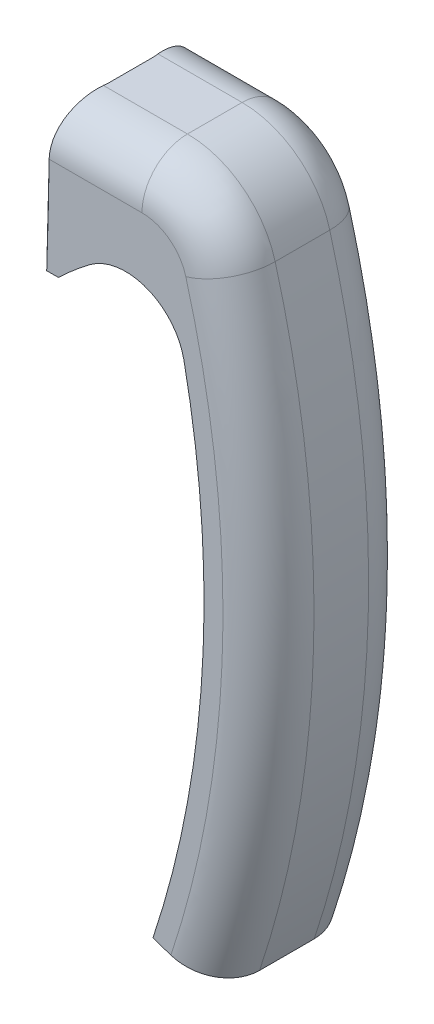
ISO-10303-21;
HEADER;
FILE_DESCRIPTION(('STEP AP214'),'2;1');
FILE_NAME('part.step','',(''),(''),'','','');
FILE_SCHEMA(('AUTOMOTIVE_DESIGN { 1 0 10303 214 1 1 1 1 }'));
ENDSEC;
DATA;
#1=APPLICATION_CONTEXT('core data for automotive mechanical design processes');
#2=APPLICATION_PROTOCOL_DEFINITION('international standard','automotive_design',2000,#1);
#3=PRODUCT_CONTEXT('',#1,'mechanical');
#4=PRODUCT('Part','Part','',(#3));
#5=PRODUCT_RELATED_PRODUCT_CATEGORY('part','',(#4));
#6=PRODUCT_DEFINITION_FORMATION('','',#4);
#7=PRODUCT_DEFINITION_CONTEXT('part definition',#1,'design');
#8=PRODUCT_DEFINITION('design','',#6,#7);
#9=PRODUCT_DEFINITION_SHAPE('','',#8);
#10=(LENGTH_UNIT() NAMED_UNIT(*) SI_UNIT(.MILLI.,.METRE.));
#11=(NAMED_UNIT(*) PLANE_ANGLE_UNIT() SI_UNIT($,.RADIAN.));
#12=(NAMED_UNIT(*) SI_UNIT($,.STERADIAN.) SOLID_ANGLE_UNIT());
#13=UNCERTAINTY_MEASURE_WITH_UNIT(LENGTH_MEASURE(1.E-05),#10,'distance_accuracy_value','');
#14=(GEOMETRIC_REPRESENTATION_CONTEXT(3) GLOBAL_UNCERTAINTY_ASSIGNED_CONTEXT((#13)) GLOBAL_UNIT_ASSIGNED_CONTEXT((#10,
#11,#12)) REPRESENTATION_CONTEXT('',''));
#15=CARTESIAN_POINT('',(0.,0.,0.));
#16=DIRECTION('',(0.,0.,1.));
#17=DIRECTION('',(1.,0.,0.));
#18=AXIS2_PLACEMENT_3D('',#15,#16,#17);
#19=CARTESIAN_POINT('',(45.,128.794707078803,10.16));
#20=DIRECTION('',(1.,0.,0.));
#21=DIRECTION('',(0.,0.,-1.));
#22=AXIS2_PLACEMENT_3D('',#19,#20,#21);
#23=PLANE('',#22);
#24=CARTESIAN_POINT('',(45.,139.827804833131,0.));
#25=CARTESIAN_POINT('',(45.,139.827812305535,0.0470504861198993));
#26=CARTESIAN_POINT('',(45.,139.832254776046,0.094139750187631));
#27=CARTESIAN_POINT('',(45.,139.849458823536,0.186781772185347));
#28=CARTESIAN_POINT('',(45.,139.862235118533,0.23233166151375));
#29=CARTESIAN_POINT('',(45.,139.89937810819,0.333538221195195));
#30=CARTESIAN_POINT('',(45.,139.926017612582,0.388348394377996));
#31=CARTESIAN_POINT('',(45.,139.987561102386,0.493074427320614));
#32=CARTESIAN_POINT('',(45.,140.022483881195,0.542978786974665));
#33=CARTESIAN_POINT('',(45.,140.127616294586,0.675574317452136));
#34=CARTESIAN_POINT('',(45.,140.204019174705,0.753281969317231));
#35=CARTESIAN_POINT('',(45.,140.366529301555,0.897626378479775));
#36=CARTESIAN_POINT('',(45.,140.452666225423,0.964227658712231));
#37=CARTESIAN_POINT('',(45.,140.682184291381,1.12535931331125));
#38=CARTESIAN_POINT('',(45.,140.829835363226,1.21373564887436));
#39=CARTESIAN_POINT('',(45.,141.132556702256,1.37693365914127));
#40=CARTESIAN_POINT('',(45.,141.287644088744,1.45172195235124));
#41=CARTESIAN_POINT('',(45.,141.603037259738,1.59173333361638));
#42=CARTESIAN_POINT('',(45.,141.76336655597,1.65690301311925));
#43=CARTESIAN_POINT('',(45.,142.086694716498,1.77947547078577));
#44=CARTESIAN_POINT('',(45.,142.249690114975,1.83688755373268));
#45=CARTESIAN_POINT('',(45.,142.75381100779,2.00409884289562));
#46=CARTESIAN_POINT('',(45.,143.098232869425,2.10393667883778));
#47=CARTESIAN_POINT('',(45.,143.791825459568,2.28569653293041));
#48=CARTESIAN_POINT('',(45.,144.140999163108,2.36760672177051));
#49=CARTESIAN_POINT('',(45.,145.194353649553,2.59334008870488));
#50=CARTESIAN_POINT('',(45.,145.902899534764,2.71673066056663));
#51=CARTESIAN_POINT('',(45.,147.326072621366,2.92668429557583));
#52=CARTESIAN_POINT('',(45.,148.040706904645,3.01319594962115));
#53=CARTESIAN_POINT('',(45.,149.471942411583,3.15657764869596));
#54=CARTESIAN_POINT('',(45.,150.188539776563,3.21348680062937));
#55=CARTESIAN_POINT('',(45.,152.016372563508,3.32632587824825));
#56=CARTESIAN_POINT('',(45.,153.128705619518,3.36463449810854));
#57=CARTESIAN_POINT('',(45.,155.354900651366,3.38643747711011));
#58=CARTESIAN_POINT('',(45.,156.468763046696,3.3698772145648));
#59=CARTESIAN_POINT('',(45.,158.690574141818,3.27981984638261));
#60=CARTESIAN_POINT('',(45.,159.798529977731,3.20651963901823));
#61=CARTESIAN_POINT('',(45.,161.454863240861,3.04497333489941));
#62=CARTESIAN_POINT('',(45.,162.00578290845,2.98256673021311));
#63=CARTESIAN_POINT('',(45.,163.104859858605,2.83716353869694));
#64=CARTESIAN_POINT('',(45.,163.653017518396,2.75416984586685));
#65=CARTESIAN_POINT('',(45.,164.743670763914,2.56246299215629));
#66=CARTESIAN_POINT('',(45.,165.286176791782,2.45381212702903));
#67=CARTESIAN_POINT('',(45.,166.093376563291,2.26329630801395));
#68=CARTESIAN_POINT('',(45.,166.361316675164,2.19521140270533));
#69=CARTESIAN_POINT('',(45.,166.893916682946,2.04733119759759));
#70=CARTESIAN_POINT('',(45.,167.158577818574,1.96754047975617));
#71=CARTESIAN_POINT('',(45.,167.683214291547,1.79205056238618));
#72=CARTESIAN_POINT('',(45.,167.943178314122,1.69631748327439));
#73=CARTESIAN_POINT('',(45.,168.454286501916,1.48185702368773));
#74=CARTESIAN_POINT('',(45.,168.705428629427,1.36312437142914));
#75=CARTESIAN_POINT('',(45.,169.066213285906,1.15528195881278));
#76=CARTESIAN_POINT('',(45.,169.18416458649,1.08076307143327));
#77=CARTESIAN_POINT('',(45.,169.409811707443,0.917716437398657));
#78=CARTESIAN_POINT('',(45.,169.517554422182,0.829258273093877));
#79=CARTESIAN_POINT('',(45.,169.656660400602,0.688577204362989));
#80=CARTESIAN_POINT('',(45.,169.69636961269,0.644696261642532));
#81=CARTESIAN_POINT('',(45.,169.770527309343,0.552520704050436));
#82=CARTESIAN_POINT('',(45.,169.804969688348,0.504221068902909));
#83=CARTESIAN_POINT('',(45.,169.866752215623,0.402145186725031));
#84=CARTESIAN_POINT('',(45.,169.893977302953,0.348297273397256));
#85=CARTESIAN_POINT('',(45.,169.937363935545,0.236343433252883));
#86=CARTESIAN_POINT('',(45.,169.953567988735,0.178254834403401));
#87=CARTESIAN_POINT('',(45.,169.969684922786,0.076087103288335));
#88=CARTESIAN_POINT('',(45.,169.972838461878,0.0325146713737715));
#89=CARTESIAN_POINT('',(45.,169.971566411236,-0.0545291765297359));
#90=CARTESIAN_POINT('',(45.,169.967140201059,-0.0980005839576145));
#91=CARTESIAN_POINT('',(45.,169.95123344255,-0.183391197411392));
#92=CARTESIAN_POINT('',(45.,169.939784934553,-0.225316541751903));
#93=CARTESIAN_POINT('',(45.,169.910930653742,-0.3070433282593));
#94=CARTESIAN_POINT('',(45.,169.893520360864,-0.346843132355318));
#95=CARTESIAN_POINT('',(45.,169.84060476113,-0.449999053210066));
#96=CARTESIAN_POINT('',(45.,169.800814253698,-0.511142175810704));
#97=CARTESIAN_POINT('',(45.,169.712546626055,-0.626796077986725));
#98=CARTESIAN_POINT('',(45.,169.664040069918,-0.681283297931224));
#99=CARTESIAN_POINT('',(45.,169.509698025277,-0.836845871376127));
#100=CARTESIAN_POINT('',(45.,169.395424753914,-0.929419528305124));
#101=CARTESIAN_POINT('',(45.,169.156297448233,-1.09935824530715));
#102=CARTESIAN_POINT('',(45.,169.031411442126,-1.17667483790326));
#103=CARTESIAN_POINT('',(45.,168.67281894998,-1.37866727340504));
#104=CARTESIAN_POINT('',(45.,168.432435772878,-1.49136879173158));
#105=CARTESIAN_POINT('',(45.,167.942872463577,-1.69609708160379));
#106=CARTESIAN_POINT('',(45.,167.693670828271,-1.78806861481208));
#107=CARTESIAN_POINT('',(45.,167.189027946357,-1.95780294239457));
#108=CARTESIAN_POINT('',(45.,166.933560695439,-2.03548812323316));
#109=CARTESIAN_POINT('',(45.,166.419915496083,-2.17962444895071));
#110=CARTESIAN_POINT('',(45.,166.161741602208,-2.24609038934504));
#111=CARTESIAN_POINT('',(45.,165.333824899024,-2.44449338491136));
#112=CARTESIAN_POINT('',(45.,164.760115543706,-2.55985137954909));
#113=CARTESIAN_POINT('',(45.,163.607576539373,-2.76187402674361));
#114=CARTESIAN_POINT('',(45.,163.028743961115,-2.84852100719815));
#115=CARTESIAN_POINT('',(45.,161.86690939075,-2.99938807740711));
#116=CARTESIAN_POINT('',(45.,161.283901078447,-3.06355911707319));
#117=CARTESIAN_POINT('',(45.,160.116076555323,-3.17281932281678));
#118=CARTESIAN_POINT('',(45.,159.531260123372,-3.21790605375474));
#119=CARTESIAN_POINT('',(45.,157.777160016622,-3.32774129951));
#120=CARTESIAN_POINT('',(45.,156.606253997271,-3.367302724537));
#121=CARTESIAN_POINT('',(45.,154.265525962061,-3.38594846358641));
#122=CARTESIAN_POINT('',(45.,153.095704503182,-3.36511093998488));
#123=CARTESIAN_POINT('',(45.,151.251469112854,-3.28172779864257));
#124=CARTESIAN_POINT('',(45.,150.576061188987,-3.24046263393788));
#125=CARTESIAN_POINT('',(45.,149.227637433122,-3.13408640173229));
#126=CARTESIAN_POINT('',(45.,148.554620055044,-3.06899564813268));
#127=CARTESIAN_POINT('',(45.,147.422249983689,-2.93530676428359));
#128=CARTESIAN_POINT('',(45.,146.962020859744,-2.87419732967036));
#129=CARTESIAN_POINT('',(45.,146.043956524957,-2.73597112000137));
#130=CARTESIAN_POINT('',(45.,145.586121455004,-2.65885341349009));
#131=CARTESIAN_POINT('',(45.,144.501613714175,-2.45200472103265));
#132=CARTESIAN_POINT('',(45.,143.876510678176,-2.31340393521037));
#133=CARTESIAN_POINT('',(45.,142.83123291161,-2.02847851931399));
#134=CARTESIAN_POINT('',(45.,142.406990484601,-1.8975517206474));
#135=CARTESIAN_POINT('',(45.,141.699654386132,-1.63469118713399));
#136=CARTESIAN_POINT('',(45.,141.412366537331,-1.51482092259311));
#137=CARTESIAN_POINT('',(45.,140.985071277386,-1.29997265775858));
#138=CARTESIAN_POINT('',(45.,140.838130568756,-1.21892743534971));
#139=CARTESIAN_POINT('',(45.,140.554772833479,-1.04027119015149));
#140=CARTESIAN_POINT('',(45.,140.418312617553,-0.942734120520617));
#141=CARTESIAN_POINT('',(45.,140.243165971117,-0.788365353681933));
#142=CARTESIAN_POINT('',(45.,140.195055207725,-0.742355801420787));
#143=CARTESIAN_POINT('',(45.,140.103977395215,-0.645228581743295));
#144=CARTESIAN_POINT('',(45.,140.061020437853,-0.594101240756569));
#145=CARTESIAN_POINT('',(45.,139.982192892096,-0.485164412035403));
#146=CARTESIAN_POINT('',(45.,139.946455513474,-0.427255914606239));
#147=CARTESIAN_POINT('',(45.,139.887228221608,-0.305548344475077));
#148=CARTESIAN_POINT('',(45.,139.863665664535,-0.241786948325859));
#149=CARTESIAN_POINT('',(45.,139.841602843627,-0.147313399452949));
#150=CARTESIAN_POINT('',(45.,139.836457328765,-0.118101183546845));
#151=CARTESIAN_POINT('',(45.,139.829555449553,-0.0592645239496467));
#152=CARTESIAN_POINT('',(45.,139.82780012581,-0.0296399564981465));
#153=CARTESIAN_POINT('',(45.,139.827804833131,0.));
#154=B_SPLINE_CURVE_WITH_KNOTS('',3,(#24,#25,#26,#27,#28,#29,#30,#31,#32,#33,#34,#35,#36,#37,
#38,#39,#40,#41,#42,#43,#44,#45,#46,#47,#48,#49,#50,#51,#52,#53,#54,#55,#56,#57,#58,#59,#60,#61,
#62,#63,#64,#65,#66,#67,#68,#69,#70,#71,#72,#73,#74,#75,#76,#77,#78,#79,#80,#81,#82,#83,#84,#85,
#86,#87,#88,#89,#90,#91,#92,#93,#94,#95,#96,#97,#98,#99,#100,#101,#102,#103,#104,#105,#106,#107,
#108,#109,#110,#111,#112,#113,#114,#115,#116,#117,#118,#119,#120,#121,#122,#123,#124,#125,#126,
#127,#128,#129,#130,#131,#132,#133,#134,#135,#136,#137,#138,#139,#140,#141,#142,#143,#144,#145,
#146,#147,#148,#149,#150,#151,#152,#153),.UNSPECIFIED.,.T.,.F.,(4,2,2,2,2,2,2,2,2,2,2,2,2,2,2,2,
2,2,2,2,2,2,2,2,2,2,2,2,2,2,2,2,2,2,2,2,2,2,2,2,2,2,2,2,2,2,2,2,2,2,2,2,2,2,2,2,2,2,2,2,2,2,2,2,
4),(0.,0.141024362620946,0.282298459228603,0.464076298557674,0.646270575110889,
0.971362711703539,1.29747418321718,1.81238765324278,2.32854948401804,2.84747746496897,
3.36577738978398,4.44074371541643,5.51641721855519,7.67234444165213,9.83126727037,
11.9873307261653,15.3247346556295,18.6654619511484,21.9946479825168,23.6576761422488,
25.3204706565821,26.9792686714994,27.808459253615,28.6373261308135,29.4679774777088,
30.2988194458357,30.7168700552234,31.1328963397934,31.3101480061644,31.4876036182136,
31.6677380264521,31.8471736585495,31.9776031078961,32.1080432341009,32.2378925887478,
32.3678406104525,32.585416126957,32.803740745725,33.24248135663,33.682594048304,
34.4769714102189,35.2734411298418,36.0741176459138,36.8737298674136,38.6280390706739,
40.3834260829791,42.1426204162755,43.9020391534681,47.4149287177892,50.9232742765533,
52.9529439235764,54.980887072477,56.373442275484,57.766078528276,59.684918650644,
61.0154272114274,61.9471516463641,62.4500791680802,62.9508085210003,63.1502361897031,
63.3500481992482,63.553264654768,63.7552541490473,63.8440666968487,63.9329065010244),.UNSPECIFIED.);
#155=CARTESIAN_POINT('',(45.,148.794707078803,-3.08871818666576));
#156=VERTEX_POINT('',#155);
#157=CARTESIAN_POINT('',(45.,148.794707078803,3.08871818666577));
#158=VERTEX_POINT('',#157);
#159=EDGE_CURVE('E50',#156,#158,#154,.T.);
#160=ORIENTED_EDGE('',*,*,#159,.T.);
#161=DIRECTION('',(0.,0.,-1.));
#162=VECTOR('',#161,1.);
#163=CARTESIAN_POINT('',(45.,148.794707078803,10.16));
#164=LINE('',#163,#162);
#165=EDGE_CURVE('E47',#158,#156,#164,.T.);
#166=ORIENTED_EDGE('',*,*,#165,.T.);
#167=EDGE_LOOP('',(#160,#166));
#168=FACE_BOUND('',#167,.T.);
#169=ADVANCED_FACE('F31',(#168),#23,.F.);
#170=CARTESIAN_POINT('',(78.0052129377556,94.4475879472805,10.16));
#171=DIRECTION('',(0.,0.,-1.));
#172=DIRECTION('',(-1.,0.,0.));
#173=AXIS2_PLACEMENT_3D('',#170,#171,#172);
#174=CYLINDRICAL_SURFACE('',#173,47.634742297);
#175=CARTESIAN_POINT('',(78.0052129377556,94.4475879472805,-10.16));
#176=DIRECTION('',(0.,0.,-1.));
#177=DIRECTION('',(1.,0.,0.));
#178=AXIS2_PLACEMENT_3D('',#175,#176,#177);
#179=CIRCLE('',#178,47.634742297);
#180=CARTESIAN_POINT('',(45.,128.794707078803,-10.16));
#181=VERTEX_POINT('',#180);
#182=CARTESIAN_POINT('',(49.4134993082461,132.547228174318,-10.16));
#183=VERTEX_POINT('',#182);
#184=EDGE_CURVE('E268',#181,#183,#179,.T.);
#185=ORIENTED_EDGE('',*,*,#184,.T.);
#186=DIRECTION('',(0.,0.,-1.));
#187=VECTOR('',#186,1.);
#188=CARTESIAN_POINT('',(49.4134993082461,132.547228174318,10.16));
#189=LINE('',#188,#187);
#190=CARTESIAN_POINT('',(49.4134993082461,132.547228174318,10.16));
#191=VERTEX_POINT('',#190);
#192=EDGE_CURVE('E265',#191,#183,#189,.T.);
#193=ORIENTED_EDGE('',*,*,#192,.F.);
#194=CARTESIAN_POINT('',(78.0052129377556,94.4475879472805,10.16));
#195=DIRECTION('',(0.,0.,-1.));
#196=DIRECTION('',(1.,0.,0.));
#197=AXIS2_PLACEMENT_3D('',#194,#195,#196);
#198=CIRCLE('',#197,47.634742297);
#199=CARTESIAN_POINT('',(45.,128.794707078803,10.16));
#200=VERTEX_POINT('',#199);
#201=EDGE_CURVE('E279',#200,#191,#198,.T.);
#202=ORIENTED_EDGE('',*,*,#201,.F.);
#203=DIRECTION('',(0.,0.,-1.));
#204=VECTOR('',#203,1.);
#205=CARTESIAN_POINT('',(45.,128.794707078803,10.16));
#206=LINE('',#205,#204);
#207=EDGE_CURVE('E296',#200,#181,#206,.T.);
#208=ORIENTED_EDGE('',*,*,#207,.T.);
#209=EDGE_LOOP('',(#185,#193,#202,#208));
#210=FACE_BOUND('',#209,.T.);
#211=ADVANCED_FACE('F208',(#210),#174,.F.);
#212=CARTESIAN_POINT('',(54.394925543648,125.909271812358,10.16));
#213=DIRECTION('',(0.,0.,-1.));
#214=DIRECTION('',(-1.,0.,0.));
#215=AXIS2_PLACEMENT_3D('',#212,#213,#214);
#216=CYLINDRICAL_SURFACE('',#215,8.29922116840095);
#217=CARTESIAN_POINT('',(54.394925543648,125.909271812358,-10.16));
#218=DIRECTION('',(0.,0.,-1.));
#219=DIRECTION('',(1.,0.,0.));
#220=AXIS2_PLACEMENT_3D('',#217,#218,#219);
#221=CIRCLE('',#220,8.29922116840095);
#222=CARTESIAN_POINT('',(62.527979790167,127.561694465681,-10.16));
#223=VERTEX_POINT('',#222);
#224=EDGE_CURVE('E259',#183,#223,#221,.T.);
#225=ORIENTED_EDGE('',*,*,#224,.T.);
#226=DIRECTION('',(0.,0.,-1.));
#227=VECTOR('',#226,1.);
#228=CARTESIAN_POINT('',(62.527979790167,127.561694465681,10.16));
#229=LINE('',#228,#227);
#230=CARTESIAN_POINT('',(62.527979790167,127.561694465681,10.16));
#231=VERTEX_POINT('',#230);
#232=EDGE_CURVE('E262',#231,#223,#229,.T.);
#233=ORIENTED_EDGE('',*,*,#232,.F.);
#234=CARTESIAN_POINT('',(54.394925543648,125.909271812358,10.16));
#235=DIRECTION('',(0.,0.,-1.));
#236=DIRECTION('',(1.,0.,0.));
#237=AXIS2_PLACEMENT_3D('',#234,#235,#236);
#238=CIRCLE('',#237,8.29922116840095);
#239=EDGE_CURVE('E338',#191,#231,#238,.T.);
#240=ORIENTED_EDGE('',*,*,#239,.F.);
#241=ORIENTED_EDGE('',*,*,#192,.T.);
#242=EDGE_LOOP('',(#225,#233,#240,#241));
#243=FACE_BOUND('',#242,.T.);
#244=ADVANCED_FACE('F213',(#243),#216,.F.);
#245=CARTESIAN_POINT('',(-74.6689416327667,99.6868894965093,10.16));
#246=DIRECTION('',(0.,0.,-1.));
#247=DIRECTION('',(-1.,0.,0.));
#248=AXIS2_PLACEMENT_3D('',#245,#246,#247);
#249=CYLINDRICAL_SURFACE('',#248,140.);
#250=CARTESIAN_POINT('',(-74.6689416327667,99.6868894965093,-10.16));
#251=DIRECTION('',(0.,0.,-1.));
#252=DIRECTION('',(1.,0.,0.));
#253=AXIS2_PLACEMENT_3D('',#250,#251,#252);
#254=CIRCLE('',#253,140.);
#255=CARTESIAN_POINT('',(58.2008498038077,55.5777235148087,-10.16));
#256=VERTEX_POINT('',#255);
#257=EDGE_CURVE('E267',#223,#256,#254,.T.);
#258=ORIENTED_EDGE('',*,*,#257,.T.);
#259=DIRECTION('',(0.,0.,-1.));
#260=VECTOR('',#259,1.);
#261=CARTESIAN_POINT('',(58.2008498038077,55.5777235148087,10.16));
#262=LINE('',#261,#260);
#263=CARTESIAN_POINT('',(58.2008498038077,55.5777235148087,10.16));
#264=VERTEX_POINT('',#263);
#265=EDGE_CURVE('E273',#264,#256,#262,.T.);
#266=ORIENTED_EDGE('',*,*,#265,.F.);
#267=CARTESIAN_POINT('',(-74.6689416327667,99.6868894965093,10.16));
#268=DIRECTION('',(0.,0.,-1.));
#269=DIRECTION('',(1.,0.,0.));
#270=AXIS2_PLACEMENT_3D('',#267,#268,#269);
#271=CIRCLE('',#270,140.);
#272=EDGE_CURVE('E272',#231,#264,#271,.T.);
#273=ORIENTED_EDGE('',*,*,#272,.F.);
#274=ORIENTED_EDGE('',*,*,#232,.T.);
#275=EDGE_LOOP('',(#258,#266,#273,#274));
#276=FACE_BOUND('',#275,.T.);
#277=ADVANCED_FACE('F246',(#276),#249,.F.);
#278=CARTESIAN_POINT('',(66.735455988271,52.740648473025,10.16));
#279=DIRECTION('',(0.31544775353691,0.948942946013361,0.));
#280=DIRECTION('',(-0.948942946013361,0.31544775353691,0.));
#281=AXIS2_PLACEMENT_3D('',#278,#279,#280);
#282=PLANE('',#281);
#283=DIRECTION('',(0.948942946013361,-0.31544775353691,0.));
#284=VECTOR('',#283,1.);
#285=CARTESIAN_POINT('',(66.735455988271,52.740648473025,-10.16));
#286=LINE('',#285,#284);
#287=CARTESIAN_POINT('',(60.7096678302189,54.7437418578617,-10.16));
#288=VERTEX_POINT('',#287);
#289=EDGE_CURVE('E277',#256,#288,#286,.T.);
#290=ORIENTED_EDGE('',*,*,#289,.T.);
#291=CARTESIAN_POINT('',(60.7096678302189,54.7437418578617,-10.16));
#292=CARTESIAN_POINT('',(60.8791494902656,54.687402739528,-10.1600192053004));
#293=CARTESIAN_POINT('',(61.0486285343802,54.6310644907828,-10.1524658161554));
#294=CARTESIAN_POINT('',(61.3863740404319,54.5187910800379,-10.1223525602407));
#295=CARTESIAN_POINT('',(61.5546405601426,54.4628558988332,-10.0997934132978));
#296=CARTESIAN_POINT('',(61.8886439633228,54.3518264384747,-10.0398299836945));
#297=CARTESIAN_POINT('',(62.0543826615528,54.2967315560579,-10.0024369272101));
#298=CARTESIAN_POINT('',(62.3822814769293,54.1877313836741,-9.9130776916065));
#299=CARTESIAN_POINT('',(62.5444416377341,54.133826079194,-9.86111169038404));
#300=CARTESIAN_POINT('',(62.8640818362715,54.0275712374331,-9.74295599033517));
#301=CARTESIAN_POINT('',(63.0215604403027,53.9752221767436,-9.67676198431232));
#302=CARTESIAN_POINT('',(63.3307238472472,53.8724500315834,-9.53060355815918));
#303=CARTESIAN_POINT('',(63.482406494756,53.8220276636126,-9.45063407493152));
#304=CARTESIAN_POINT('',(63.7787826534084,53.7235062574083,-9.27754240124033));
#305=CARTESIAN_POINT('',(63.9234787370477,53.6754063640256,-9.18442510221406));
#306=CARTESIAN_POINT('',(64.2049164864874,53.5818507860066,-8.98567522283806));
#307=CARTESIAN_POINT('',(64.3416579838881,53.53639515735,-8.88004237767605));
#308=CARTESIAN_POINT('',(64.6062084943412,53.4484532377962,-8.65701614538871));
#309=CARTESIAN_POINT('',(64.7340176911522,53.405966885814,-8.53962300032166));
#310=CARTESIAN_POINT('',(64.9797982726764,53.3242644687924,-8.29390876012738));
#311=CARTESIAN_POINT('',(65.0977696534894,53.2850484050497,-8.16558766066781));
#312=CARTESIAN_POINT('',(65.3230592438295,53.2101576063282,-7.89890209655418));
#313=CARTESIAN_POINT('',(65.4303752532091,53.1744836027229,-7.76053556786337));
#314=CARTESIAN_POINT('',(65.6335612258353,53.1069404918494,-7.47476957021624));
#315=CARTESIAN_POINT('',(65.7294314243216,53.0750713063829,-7.32737028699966));
#316=CARTESIAN_POINT('',(65.9090815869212,53.0153519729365,-7.02452485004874));
#317=CARTESIAN_POINT('',(65.9928568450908,52.9875033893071,-6.86907559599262));
#318=CARTESIAN_POINT('',(66.1476483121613,52.9360475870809,-6.55134915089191));
#319=CARTESIAN_POINT('',(66.2186691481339,52.9124388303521,-6.3890744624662));
#320=CARTESIAN_POINT('',(66.3474664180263,52.869624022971,-6.05883697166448));
#321=CARTESIAN_POINT('',(66.4052466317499,52.8504167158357,-5.8908758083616));
#322=CARTESIAN_POINT('',(66.5071633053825,52.8165375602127,-5.55048788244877));
#323=CARTESIAN_POINT('',(66.5513030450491,52.8018646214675,-5.37806220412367));
#324=CARTESIAN_POINT('',(66.6372974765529,52.7732783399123,-4.97527137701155));
#325=CARTESIAN_POINT('',(66.6741056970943,52.7610425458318,-4.74367512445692));
#326=CARTESIAN_POINT('',(66.7109115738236,52.7488075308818,-4.39442105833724));
#327=CARTESIAN_POINT('',(66.7201124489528,52.7457489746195,-4.2777522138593));
#328=CARTESIAN_POINT('',(66.7323838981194,52.7416696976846,-4.0440651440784));
#329=CARTESIAN_POINT('',(66.7354548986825,52.7406488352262,-3.92704694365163));
#330=CARTESIAN_POINT('',(66.735455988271,52.740648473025,-3.80999999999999));
#331=B_SPLINE_CURVE_WITH_KNOTS('',3,(#291,#292,#293,#294,#295,#296,#297,#298,#299,#300,#301,
#302,#303,#304,#305,#306,#307,#308,#309,#310,#311,#312,#313,#314,#315,#316,#317,#318,#319,#320,
#321,#322,#323,#324,#325,#326,#327,#328,#329,#330),.UNSPECIFIED.,.F.,.F.,(4,2,2,2,2,2,2,2,2,2,2,
2,2,2,2,2,2,2,2,4),(0.,0.535637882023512,1.07125007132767,1.60645768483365,2.14165876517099,
2.67702209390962,3.21258261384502,3.74794440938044,4.28331753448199,4.81867964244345,
5.3540419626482,5.88951459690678,6.42497622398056,6.96064563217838,7.4961203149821,
8.03144194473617,8.56663475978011,9.26946677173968,9.62052993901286,9.97156867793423),.UNSPECIFIED.);
#332=CARTESIAN_POINT('',(66.735455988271,52.740648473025,-3.81));
#333=VERTEX_POINT('',#332);
#334=EDGE_CURVE('E226',#288,#333,#331,.T.);
#335=ORIENTED_EDGE('',*,*,#334,.T.);
#336=DIRECTION('',(0.,0.,-1.));
#337=VECTOR('',#336,1.);
#338=CARTESIAN_POINT('',(66.735455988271,52.740648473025,10.16));
#339=LINE('',#338,#337);
#340=CARTESIAN_POINT('',(66.735455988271,52.740648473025,3.81));
#341=VERTEX_POINT('',#340);
#342=EDGE_CURVE('E291',#341,#333,#339,.T.);
#343=ORIENTED_EDGE('',*,*,#342,.F.);
#344=CARTESIAN_POINT('',(66.735455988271,52.740648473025,3.81));
#345=CARTESIAN_POINT('',(66.7354742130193,52.7406424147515,3.98860044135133));
#346=CARTESIAN_POINT('',(66.7283064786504,52.7430251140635,4.16719812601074));
#347=CARTESIAN_POINT('',(66.6997307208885,52.7525242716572,4.52311567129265));
#348=CARTESIAN_POINT('',(66.6783233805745,52.7596405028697,4.70043559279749));
#349=CARTESIAN_POINT('',(66.6214215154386,52.7785558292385,5.0524096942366));
#350=CARTESIAN_POINT('',(66.5859376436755,52.7903513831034,5.22706578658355));
#351=CARTESIAN_POINT('',(66.5011408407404,52.8185395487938,5.57260684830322));
#352=CARTESIAN_POINT('',(66.4518280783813,52.8349321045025,5.743491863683));
#353=CARTESIAN_POINT('',(66.3397050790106,52.8722040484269,6.08032996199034));
#354=CARTESIAN_POINT('',(66.2768907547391,52.8930847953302,6.24628153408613));
#355=CARTESIAN_POINT('',(66.1381947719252,52.9391901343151,6.57207914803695));
#356=CARTESIAN_POINT('',(66.0623083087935,52.9644163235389,6.73192291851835));
#357=CARTESIAN_POINT('',(65.8980542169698,53.0190176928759,7.0442452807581));
#358=CARTESIAN_POINT('',(65.8096912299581,53.0483913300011,7.19672658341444));
#359=CARTESIAN_POINT('',(65.6210889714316,53.1110865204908,7.49330679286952));
#360=CARTESIAN_POINT('',(65.5208494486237,53.1444081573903,7.63740552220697));
#361=CARTESIAN_POINT('',(65.3092103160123,53.214761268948,7.91618990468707));
#362=CARTESIAN_POINT('',(65.1978109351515,53.251792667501,8.05087575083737));
#363=CARTESIAN_POINT('',(64.9646421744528,53.3293026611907,8.30988031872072));
#364=CARTESIAN_POINT('',(64.8428727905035,53.3697812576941,8.43419903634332));
#365=CARTESIAN_POINT('',(64.5898034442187,53.4539066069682,8.67161011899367));
#366=CARTESIAN_POINT('',(64.4585015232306,53.4975540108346,8.78470016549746));
#367=CARTESIAN_POINT('',(64.1873259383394,53.5876982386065,8.99881837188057));
#368=CARTESIAN_POINT('',(64.0474524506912,53.6341950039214,9.09984677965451));
#369=CARTESIAN_POINT('',(63.7600694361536,53.7297269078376,9.28916287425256));
#370=CARTESIAN_POINT('',(63.6125569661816,53.7787630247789,9.3774456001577));
#371=CARTESIAN_POINT('',(63.311052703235,53.8789891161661,9.54056551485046));
#372=CARTESIAN_POINT('',(63.1570632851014,53.9301783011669,9.61540757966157));
#373=CARTESIAN_POINT('',(62.8436867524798,54.0343509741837,9.75113470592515));
#374=CARTESIAN_POINT('',(62.6843011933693,54.0873339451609,9.81202375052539));
#375=CARTESIAN_POINT('',(62.3612924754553,54.1947085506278,9.91942399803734));
#376=CARTESIAN_POINT('',(62.1976703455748,54.2490998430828,9.9659386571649));
#377=CARTESIAN_POINT('',(61.8154446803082,54.3761593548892,10.0565600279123));
#378=CARTESIAN_POINT('',(61.5956728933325,54.4492159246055,10.0953487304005));
#379=CARTESIAN_POINT('',(61.2642504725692,54.5593874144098,10.1341349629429));
#380=CARTESIAN_POINT('',(61.1535383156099,54.5961903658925,10.1438308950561));
#381=CARTESIAN_POINT('',(60.9317824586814,54.6699064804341,10.1567626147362));
#382=CARTESIAN_POINT('',(60.8207387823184,54.7068196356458,10.1599988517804));
#383=CARTESIAN_POINT('',(60.7096678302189,54.7437418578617,10.16));
#384=B_SPLINE_CURVE_WITH_KNOTS('',3,(#344,#345,#346,#347,#348,#349,#350,#351,#352,#353,#354,
#355,#356,#357,#358,#359,#360,#361,#362,#363,#364,#365,#366,#367,#368,#369,#370,#371,#372,#373,
#374,#375,#376,#377,#378,#379,#380,#381,#382,#383),.UNSPECIFIED.,.F.,.F.,(4,2,2,2,2,2,2,2,2,2,2,
2,2,2,2,2,2,2,2,4),(0.,0.535637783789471,1.07124987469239,1.60645738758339,2.14165836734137,
2.67702159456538,3.21258201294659,3.74794370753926,4.28331673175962,4.81867877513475,
5.35404103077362,5.88951360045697,6.42497516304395,6.96064458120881,7.49611927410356,
8.03144091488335,8.56663374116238,9.2694662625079,9.62052968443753,9.97156867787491),.UNSPECIFIED.);
#385=CARTESIAN_POINT('',(60.7096678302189,54.7437418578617,10.16));
#386=VERTEX_POINT('',#385);
#387=EDGE_CURVE('E234',#341,#386,#384,.T.);
#388=ORIENTED_EDGE('',*,*,#387,.T.);
#389=DIRECTION('',(0.948942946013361,-0.31544775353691,0.));
#390=VECTOR('',#389,1.);
#391=CARTESIAN_POINT('',(66.735455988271,52.740648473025,10.16));
#392=LINE('',#391,#390);
#393=EDGE_CURVE('E285',#264,#386,#392,.T.);
#394=ORIENTED_EDGE('',*,*,#393,.F.);
#395=ORIENTED_EDGE('',*,*,#265,.T.);
#396=EDGE_LOOP('',(#290,#335,#343,#388,#394,#395));
#397=FACE_BOUND('',#396,.T.);
#398=ADVANCED_FACE('F240',(#397),#282,.F.);
#399=CARTESIAN_POINT('',(-74.6689416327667,99.6868894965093,10.16));
#400=DIRECTION('',(0.,0.,-1.));
#401=DIRECTION('',(-1.,0.,0.));
#402=AXIS2_PLACEMENT_3D('',#399,#400,#401);
#403=CYLINDRICAL_SURFACE('',#402,148.993802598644);
#404=ORIENTED_EDGE('',*,*,#342,.T.);
#405=CARTESIAN_POINT('',(-74.6689416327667,99.6868894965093,-3.81));
#406=DIRECTION('',(0.,0.,1.));
#407=DIRECTION('',(1.,0.,0.));
#408=AXIS2_PLACEMENT_3D('',#405,#406,#407);
#409=CIRCLE('',#408,148.993802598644);
#410=CARTESIAN_POINT('',(68.9106057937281,139.487225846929,-3.81));
#411=VERTEX_POINT('',#410);
#412=EDGE_CURVE('E141',#333,#411,#409,.T.);
#413=ORIENTED_EDGE('',*,*,#412,.T.);
#414=DIRECTION('',(0.,0.,-1.));
#415=VECTOR('',#414,1.);
#416=CARTESIAN_POINT('',(68.9106057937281,139.487225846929,10.16));
#417=LINE('',#416,#415);
#418=CARTESIAN_POINT('',(68.9106057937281,139.487225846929,3.81));
#419=VERTEX_POINT('',#418);
#420=EDGE_CURVE('E288',#419,#411,#417,.T.);
#421=ORIENTED_EDGE('',*,*,#420,.F.);
#422=CARTESIAN_POINT('',(-74.6689416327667,99.6868894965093,3.81));
#423=DIRECTION('',(0.,0.,1.));
#424=DIRECTION('',(1.,0.,0.));
#425=AXIS2_PLACEMENT_3D('',#422,#423,#424);
#426=CIRCLE('',#425,148.993802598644);
#427=EDGE_CURVE('E299',#419,#341,#426,.F.);
#428=ORIENTED_EDGE('',*,*,#427,.T.);
#429=EDGE_LOOP('',(#404,#413,#421,#428));
#430=FACE_BOUND('',#429,.T.);
#431=ADVANCED_FACE('F245',(#430),#403,.T.);
#432=CARTESIAN_POINT('',(56.6721084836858,136.094707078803,10.16));
#433=DIRECTION('',(0.,0.,-1.));
#434=DIRECTION('',(-1.,0.,0.));
#435=AXIS2_PLACEMENT_3D('',#432,#433,#434);
#436=CYLINDRICAL_SURFACE('',#435,12.7);
#437=ORIENTED_EDGE('',*,*,#420,.T.);
#438=CARTESIAN_POINT('',(56.6721084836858,136.094707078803,-3.81));
#439=DIRECTION('',(0.,0.,1.));
#440=DIRECTION('',(1.,0.,0.));
#441=AXIS2_PLACEMENT_3D('',#438,#439,#440);
#442=CIRCLE('',#441,12.7);
#443=CARTESIAN_POINT('',(56.6721084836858,148.794707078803,-3.81));
#444=VERTEX_POINT('',#443);
#445=EDGE_CURVE('E352',#411,#444,#442,.T.);
#446=ORIENTED_EDGE('',*,*,#445,.T.);
#447=DIRECTION('',(0.,0.,-1.));
#448=VECTOR('',#447,1.);
#449=CARTESIAN_POINT('',(56.6721084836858,148.794707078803,10.16));
#450=LINE('',#449,#448);
#451=CARTESIAN_POINT('',(56.6721084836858,148.794707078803,3.81));
#452=VERTEX_POINT('',#451);
#453=EDGE_CURVE('E284',#452,#444,#450,.T.);
#454=ORIENTED_EDGE('',*,*,#453,.F.);
#455=CARTESIAN_POINT('',(56.6721084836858,136.094707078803,3.81));
#456=DIRECTION('',(0.,0.,1.));
#457=DIRECTION('',(1.,0.,0.));
#458=AXIS2_PLACEMENT_3D('',#455,#456,#457);
#459=CIRCLE('',#458,12.7);
#460=EDGE_CURVE('E233',#452,#419,#459,.F.);
#461=ORIENTED_EDGE('',*,*,#460,.T.);
#462=EDGE_LOOP('',(#437,#446,#454,#461));
#463=FACE_BOUND('',#462,.T.);
#464=ADVANCED_FACE('F349',(#463),#436,.T.);
#465=CARTESIAN_POINT('',(45.,148.794707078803,10.16));
#466=DIRECTION('',(0.,-1.,0.));
#467=DIRECTION('',(1.,0.,0.));
#468=AXIS2_PLACEMENT_3D('',#465,#466,#467);
#469=PLANE('',#468);
#470=ORIENTED_EDGE('',*,*,#453,.T.);
#471=DIRECTION('',(-1.,0.,0.));
#472=VECTOR('',#471,1.);
#473=CARTESIAN_POINT('',(45.,148.794707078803,-3.81));
#474=LINE('',#473,#472);
#475=CARTESIAN_POINT('',(44.937160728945,148.794707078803,-3.81));
#476=VERTEX_POINT('',#475);
#477=EDGE_CURVE('E11',#444,#476,#474,.T.);
#478=ORIENTED_EDGE('',*,*,#477,.T.);
#479=CARTESIAN_POINT('',(5.37614175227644,148.794707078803,0.));
#480=DIRECTION('',(0.,-1.,0.));
#481=DIRECTION('',(0.,0.,-1.));
#482=AXIS2_PLACEMENT_3D('',#479,#480,#481);
#483=CIRCLE('',#482,39.7440602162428);
#484=EDGE_CURVE('E149',#476,#156,#483,.T.);
#485=ORIENTED_EDGE('',*,*,#484,.T.);
#486=ORIENTED_EDGE('',*,*,#165,.F.);
#487=CARTESIAN_POINT('',(44.937160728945,148.794707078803,3.81));
#488=VERTEX_POINT('',#487);
#489=EDGE_CURVE('E329',#158,#488,#483,.T.);
#490=ORIENTED_EDGE('',*,*,#489,.T.);
#491=DIRECTION('',(-1.,0.,0.));
#492=VECTOR('',#491,1.);
#493=CARTESIAN_POINT('',(56.6721084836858,148.794707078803,3.81));
#494=LINE('',#493,#492);
#495=EDGE_CURVE('E40',#488,#452,#494,.F.);
#496=ORIENTED_EDGE('',*,*,#495,.T.);
#497=EDGE_LOOP('',(#470,#478,#485,#486,#490,#496));
#498=FACE_BOUND('',#497,.T.);
#499=ADVANCED_FACE('F347',(#498),#469,.F.);
#500=CARTESIAN_POINT('',(56.6721084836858,136.094707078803,10.16));
#501=DIRECTION('',(0.,0.,1.));
#502=DIRECTION('',(1.,0.,0.));
#503=AXIS2_PLACEMENT_3D('',#500,#501,#502);
#504=PLANE('',#503);
#505=ORIENTED_EDGE('',*,*,#393,.T.);
#506=CARTESIAN_POINT('',(-74.6689416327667,99.6868894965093,10.16));
#507=DIRECTION('',(0.,0.,1.));
#508=DIRECTION('',(1.,0.,0.));
#509=AXIS2_PLACEMENT_3D('',#506,#507,#508);
#510=CIRCLE('',#509,142.643802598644);
#511=CARTESIAN_POINT('',(62.7913571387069,137.790966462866,10.16));
#512=VERTEX_POINT('',#511);
#513=EDGE_CURVE('E314',#386,#512,#510,.T.);
#514=ORIENTED_EDGE('',*,*,#513,.T.);
#515=CARTESIAN_POINT('',(56.6721084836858,136.094707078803,10.16));
#516=DIRECTION('',(0.,0.,1.));
#517=DIRECTION('',(1.,0.,0.));
#518=AXIS2_PLACEMENT_3D('',#515,#516,#517);
#519=CIRCLE('',#518,6.35);
#520=CARTESIAN_POINT('',(56.6721084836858,142.444707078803,10.16));
#521=VERTEX_POINT('',#520);
#522=EDGE_CURVE('E319',#512,#521,#519,.T.);
#523=ORIENTED_EDGE('',*,*,#522,.T.);
#524=DIRECTION('',(-1.,0.,0.));
#525=VECTOR('',#524,1.);
#526=CARTESIAN_POINT('',(45.,142.444707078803,10.16));
#527=LINE('',#526,#525);
#528=CARTESIAN_POINT('',(43.7224629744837,142.444707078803,10.16));
#529=VERTEX_POINT('',#528);
#530=EDGE_CURVE('E322',#521,#529,#527,.T.);
#531=ORIENTED_EDGE('',*,*,#530,.T.);
#532=CARTESIAN_POINT('',(-26.103183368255,52.3118240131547,10.16));
#533=CARTESIAN_POINT('',(-26.7683967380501,57.1455465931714,10.16));
#534=CARTESIAN_POINT('',(-27.3847695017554,61.9859481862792,10.16));
#535=CARTESIAN_POINT('',(-28.52144345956,71.6783099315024,10.16));
#536=CARTESIAN_POINT('',(-29.0417389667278,76.5302707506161,10.16));
#537=CARTESIAN_POINT('',(-29.9882532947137,86.2537993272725,10.16));
#538=CARTESIAN_POINT('',(-30.4142696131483,91.1253868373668,10.16));
#539=CARTESIAN_POINT('',(-30.9821471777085,98.4378805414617,10.16));
#540=CARTESIAN_POINT('',(-31.1595724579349,100.876068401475,10.16));
#541=CARTESIAN_POINT('',(-31.4907834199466,105.754084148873,10.16));
#542=CARTESIAN_POINT('',(-31.6445685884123,108.193912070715,10.16));
#543=CARTESIAN_POINT('',(-32.3646252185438,120.569986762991,10.16));
#544=CARTESIAN_POINT('',(-32.7472935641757,130.517698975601,10.16));
#545=CARTESIAN_POINT('',(-33.1235196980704,150.421744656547,10.16));
#546=CARTESIAN_POINT('',(-33.1170064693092,160.378079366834,10.16));
#547=CARTESIAN_POINT('',(-32.7142484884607,180.304690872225,10.16));
#548=CARTESIAN_POINT('',(-32.3171672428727,190.27495172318,10.16));
#549=CARTESIAN_POINT('',(-31.4270392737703,205.210995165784,10.16));
#550=CARTESIAN_POINT('',(-31.0812922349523,210.185981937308,10.16));
#551=CARTESIAN_POINT('',(-30.2911267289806,220.128167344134,10.16));
#552=CARTESIAN_POINT('',(-29.8467088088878,225.095366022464,10.16));
#553=CARTESIAN_POINT('',(-28.8610354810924,234.994053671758,10.16));
#554=CARTESIAN_POINT('',(-28.3202955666,239.92559403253,10.16));
#555=CARTESIAN_POINT('',(-27.1392882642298,249.776832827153,10.16));
#556=CARTESIAN_POINT('',(-26.4990191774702,254.696531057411,10.16));
#557=CARTESIAN_POINT('',(-25.116716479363,264.525112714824,10.16));
#558=CARTESIAN_POINT('',(-24.3746134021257,269.433986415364,10.16));
#559=CARTESIAN_POINT('',(-23.1832189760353,276.784410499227,10.16));
#560=CARTESIAN_POINT('',(-22.7730561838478,279.232357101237,10.16));
#561=CARTESIAN_POINT('',(-21.9260846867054,284.12364685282,10.16));
#562=CARTESIAN_POINT('',(-21.4892760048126,286.566990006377,10.16));
#563=CARTESIAN_POINT('',(-20.589751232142,291.440849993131,10.16));
#564=CARTESIAN_POINT('',(-20.127122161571,293.871382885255,10.16));
#565=CARTESIAN_POINT('',(-19.1737574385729,298.726928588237,10.16));
#566=CARTESIAN_POINT('',(-18.6830218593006,301.151941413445,10.16));
#567=CARTESIAN_POINT('',(-17.6720603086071,305.996337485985,10.16));
#568=CARTESIAN_POINT('',(-17.1518283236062,308.415719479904,10.16));
#569=CARTESIAN_POINT('',(-16.0801664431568,313.247542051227,10.16));
#570=CARTESIAN_POINT('',(-15.5287368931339,315.659982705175,10.16));
#571=CARTESIAN_POINT('',(-14.39270249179,320.474293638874,10.16));
#572=CARTESIAN_POINT('',(-13.80813447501,322.876172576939,10.16));
#573=CARTESIAN_POINT('',(-12.9029837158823,326.471919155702,10.16));
#574=CARTESIAN_POINT('',(-12.5965413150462,327.669356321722,10.16));
#575=CARTESIAN_POINT('',(-11.9735046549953,330.06158895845,10.16));
#576=CARTESIAN_POINT('',(-11.656910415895,331.256384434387,10.16));
#577=CARTESIAN_POINT('',(-11.012794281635,333.642591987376,10.16));
#578=CARTESIAN_POINT('',(-10.6852761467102,334.834005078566,10.16));
#579=CARTESIAN_POINT('',(-10.0180457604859,337.213410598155,10.16));
#580=CARTESIAN_POINT('',(-9.67833357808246,338.40140304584,10.16));
#581=CARTESIAN_POINT('',(-8.98518688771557,340.773266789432,10.16));
#582=CARTESIAN_POINT('',(-8.63175361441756,341.957138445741,10.16));
#583=CARTESIAN_POINT('',(-7.90901694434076,344.320015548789,10.16));
#584=CARTESIAN_POINT('',(-7.53971399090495,345.499021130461,10.16));
#585=CARTESIAN_POINT('',(-7.07003233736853,346.957201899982,10.16));
#586=CARTESIAN_POINT('',(-6.97857833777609,347.239261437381,10.16));
#587=CARTESIAN_POINT('',(-6.79451853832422,347.803005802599,10.16));
#588=CARTESIAN_POINT('',(-6.70191273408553,348.084690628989,10.16));
#589=CARTESIAN_POINT('',(-6.42228144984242,348.929152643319,10.16));
#590=CARTESIAN_POINT('',(-6.23344400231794,349.491331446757,10.16));
#591=CARTESIAN_POINT('',(-5.85035229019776,350.613962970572,10.16));
#592=CARTESIAN_POINT('',(-5.65609698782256,351.174415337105,10.16));
#593=CARTESIAN_POINT('',(-5.26152200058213,352.293182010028,10.16));
#594=CARTESIAN_POINT('',(-5.06120234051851,352.851496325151,10.16));
#595=CARTESIAN_POINT('',(-4.65347365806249,353.966046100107,10.16));
#596=CARTESIAN_POINT('',(-4.44605904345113,354.522279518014,10.16));
#597=CARTESIAN_POINT('',(-4.02318294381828,355.631698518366,10.16));
#598=CARTESIAN_POINT('',(-3.80772129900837,356.184884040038,10.16));
#599=CARTESIAN_POINT('',(-3.36738121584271,357.287282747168,10.16));
#600=CARTESIAN_POINT('',(-3.14250610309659,357.836497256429,10.16));
#601=CARTESIAN_POINT('',(-2.6813253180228,358.93008299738,10.16));
#602=CARTESIAN_POINT('',(-2.44502029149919,359.474454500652,10.16));
#603=CARTESIAN_POINT('',(-1.95741740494,360.558773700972,10.16));
#604=CARTESIAN_POINT('',(-1.70607028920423,361.098699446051,10.16));
#605=CARTESIAN_POINT('',(-1.31527493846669,361.902092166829,10.16));
#606=CARTESIAN_POINT('',(-1.18266972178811,362.168890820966,10.16));
#607=CARTESIAN_POINT('',(-0.912181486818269,362.699801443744,10.16));
#608=CARTESIAN_POINT('',(-0.774298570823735,362.963913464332,10.16));
#609=CARTESIAN_POINT('',(-0.492459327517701,363.488757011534,10.16));
#610=CARTESIAN_POINT('',(-0.348505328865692,363.749489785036,10.16));
#611=CARTESIAN_POINT('',(-0.053395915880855,364.266843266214,10.16));
#612=CARTESIAN_POINT('',(0.0977590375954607,364.523464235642,10.16));
#613=CARTESIAN_POINT('',(0.408530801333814,365.031203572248,10.16));
#614=CARTESIAN_POINT('',(0.568139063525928,365.282327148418,10.16));
#615=CARTESIAN_POINT('',(0.897762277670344,365.777612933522,10.16));
#616=CARTESIAN_POINT('',(1.06777432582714,366.021777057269,10.16));
#617=CARTESIAN_POINT('',(1.37895961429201,366.443954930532,10.16));
#618=CARTESIAN_POINT('',(1.51743624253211,366.623949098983,10.16));
#619=CARTESIAN_POINT('',(1.8034498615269,366.976780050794,10.16));
#620=CARTESIAN_POINT('',(1.95099076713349,367.149613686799,10.16));
#621=CARTESIAN_POINT('',(2.25626961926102,367.484852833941,10.16));
#622=CARTESIAN_POINT('',(2.41396413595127,367.647297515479,10.16));
#623=CARTESIAN_POINT('',(2.74209623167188,367.958623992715,10.16));
#624=CARTESIAN_POINT('',(2.91252018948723,368.107519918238,10.16));
#625=CARTESIAN_POINT('',(3.25185218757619,368.373024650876,10.16));
#626=CARTESIAN_POINT('',(3.41939157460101,368.491353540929,10.16));
#627=CARTESIAN_POINT('',(3.76838722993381,368.705970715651,10.16));
#628=CARTESIAN_POINT('',(3.9498476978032,368.802252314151,10.16));
#629=CARTESIAN_POINT('',(4.32953175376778,368.965339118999,10.16));
#630=CARTESIAN_POINT('',(4.52797005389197,369.031668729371,10.16));
#631=CARTESIAN_POINT('',(4.83226269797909,369.100176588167,10.16));
#632=CARTESIAN_POINT('',(4.93472229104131,369.117846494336,10.16));
#633=CARTESIAN_POINT('',(5.14092614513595,369.142205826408,10.16));
#634=CARTESIAN_POINT('',(5.24467013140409,369.148897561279,10.16));
#635=CARTESIAN_POINT('',(5.52606019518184,369.151558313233,10.16));
#636=CARTESIAN_POINT('',(5.70392237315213,369.136552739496,10.16));
#637=CARTESIAN_POINT('',(6.05412204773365,369.075178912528,10.16));
#638=CARTESIAN_POINT('',(6.2264507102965,369.028762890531,10.16));
#639=CARTESIAN_POINT('',(6.61430220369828,368.891416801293,10.16));
#640=CARTESIAN_POINT('',(6.82643961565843,368.791095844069,10.16));
#641=CARTESIAN_POINT('',(7.23265522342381,368.559089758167,10.16));
#642=CARTESIAN_POINT('',(7.42668951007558,368.427330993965,10.16));
#643=CARTESIAN_POINT('',(7.79117907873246,368.148017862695,10.16));
#644=CARTESIAN_POINT('',(7.96224776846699,368.001247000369,10.16));
#645=CARTESIAN_POINT('',(8.29154568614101,367.693818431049,10.16));
#646=CARTESIAN_POINT('',(8.44976158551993,367.533146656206,10.16));
#647=CARTESIAN_POINT('',(8.75580683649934,367.201415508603,10.16));
#648=CARTESIAN_POINT('',(8.90360395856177,367.030326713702,10.16));
#649=CARTESIAN_POINT('',(9.19004517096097,366.680853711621,10.16));
#650=CARTESIAN_POINT('',(9.32869389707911,366.502473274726,10.16));
#651=CARTESIAN_POINT('',(9.59479623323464,366.14489878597,10.16));
#652=CARTESIAN_POINT('',(9.72244947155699,365.96585243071,10.16));
#653=CARTESIAN_POINT('',(9.97161951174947,365.603528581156,10.16));
#654=CARTESIAN_POINT('',(10.0931355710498,365.420250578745,10.16));
#655=CARTESIAN_POINT('',(10.449932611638,364.865157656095,10.16));
#656=CARTESIAN_POINT('',(10.6773259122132,364.488271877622,10.16));
#657=CARTESIAN_POINT('',(11.1165813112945,363.724572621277,10.16));
#658=CARTESIAN_POINT('',(11.3284078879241,363.33773900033,10.16));
#659=CARTESIAN_POINT('',(11.7394128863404,362.557378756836,10.16));
#660=CARTESIAN_POINT('',(11.9385897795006,362.163851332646,10.16));
#661=CARTESIAN_POINT('',(12.3276193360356,361.369883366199,10.16));
#662=CARTESIAN_POINT('',(12.5174223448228,360.969418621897,10.16));
#663=CARTESIAN_POINT('',(12.8884665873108,360.164523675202,10.16));
#664=CARTESIAN_POINT('',(13.0697072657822,359.760093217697,10.16));
#665=CARTESIAN_POINT('',(13.424682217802,358.948697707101,10.16));
#666=CARTESIAN_POINT('',(13.5984275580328,358.541737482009,10.16));
#667=CARTESIAN_POINT('',(13.9397265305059,357.725247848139,10.16));
#668=CARTESIAN_POINT('',(14.107280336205,357.315718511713,10.16));
#669=CARTESIAN_POINT('',(14.4349772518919,356.499559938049,10.16));
#670=CARTESIAN_POINT('',(14.5951862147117,356.092957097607,10.16));
#671=CARTESIAN_POINT('',(14.9109727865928,355.277955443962,10.16));
#672=CARTESIAN_POINT('',(15.0665503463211,354.869556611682,10.16));
#673=CARTESIAN_POINT('',(15.5271326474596,353.642004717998,10.16));
#674=CARTESIAN_POINT('',(15.8259714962,352.820535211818,10.16));
#675=CARTESIAN_POINT('',(16.410326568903,351.172685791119,10.16));
#676=CARTESIAN_POINT('',(16.6958397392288,350.346304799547,10.16));
#677=CARTESIAN_POINT('',(17.2556061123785,348.689731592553,10.16));
#678=CARTESIAN_POINT('',(17.5298591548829,347.859539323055,10.16));
#679=CARTESIAN_POINT('',(18.0690355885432,346.194906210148,10.16));
#680=CARTESIAN_POINT('',(18.333945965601,345.360461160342,10.16));
#681=CARTESIAN_POINT('',(18.8552384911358,343.688910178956,10.16));
#682=CARTESIAN_POINT('',(19.1116205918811,342.851804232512,10.16));
#683=CARTESIAN_POINT('',(19.6167385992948,341.175416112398,10.16));
#684=CARTESIAN_POINT('',(19.8654755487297,340.3361342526,10.16));
#685=CARTESIAN_POINT('',(20.3560553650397,338.655557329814,10.16));
#686=CARTESIAN_POINT('',(20.597898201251,337.814262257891,10.16));
#687=CARTESIAN_POINT('',(21.312486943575,335.292957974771,10.16));
#688=CARTESIAN_POINT('',(21.7758636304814,333.610287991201,10.16));
#689=CARTESIAN_POINT('',(22.6809626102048,330.239108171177,10.16));
#690=CARTESIAN_POINT('',(23.1226843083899,328.550598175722,10.16));
#691=CARTESIAN_POINT('',(23.9864396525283,325.169800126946,10.16));
#692=CARTESIAN_POINT('',(24.4084867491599,323.477515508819,10.16));
#693=CARTESIAN_POINT('',(25.0282544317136,320.935855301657,10.16));
#694=CARTESIAN_POINT('',(25.2326268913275,320.088094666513,10.16));
#695=CARTESIAN_POINT('',(25.6370936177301,318.391549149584,10.16));
#696=CARTESIAN_POINT('',(25.83718786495,317.542764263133,10.16));
#697=CARTESIAN_POINT('',(26.4331831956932,314.986755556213,10.16));
#698=CARTESIAN_POINT('',(26.822803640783,313.278063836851,10.16));
#699=CARTESIAN_POINT('',(27.5862710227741,309.857155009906,10.16));
#700=CARTESIAN_POINT('',(27.9601178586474,308.144937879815,10.16));
#701=CARTESIAN_POINT('',(28.6927467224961,304.717233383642,10.16));
#702=CARTESIAN_POINT('',(29.0515283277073,303.001745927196,10.16));
#703=CARTESIAN_POINT('',(29.7545590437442,299.56779330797,10.16));
#704=CARTESIAN_POINT('',(30.0988080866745,297.849328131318,10.16));
#705=CARTESIAN_POINT('',(31.1105052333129,292.689388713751,10.16));
#706=CARTESIAN_POINT('',(31.7568224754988,289.243750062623,10.16));
#707=CARTESIAN_POINT('',(32.9956173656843,282.342820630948,10.16));
#708=CARTESIAN_POINT('',(33.5880947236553,278.88752979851,10.16));
#709=CARTESIAN_POINT('',(34.7213072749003,271.965615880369,10.16));
#710=CARTESIAN_POINT('',(35.2620003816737,268.498985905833,10.16));
#711=CARTESIAN_POINT('',(36.2922485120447,261.558134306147,10.16));
#712=CARTESIAN_POINT('',(36.7818033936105,258.083912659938,10.16));
#713=CARTESIAN_POINT('',(37.7105491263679,251.12898119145,10.16));
#714=CARTESIAN_POINT('',(38.1497434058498,247.648271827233,10.16));
#715=CARTESIAN_POINT('',(38.9783818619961,240.680928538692,10.16));
#716=CARTESIAN_POINT('',(39.367825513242,237.19429455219,10.16));
#717=CARTESIAN_POINT('',(40.4630494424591,226.718399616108,10.16));
#718=CARTESIAN_POINT('',(41.0946448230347,219.721236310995,10.16));
#719=CARTESIAN_POINT('',(42.1622856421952,205.711995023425,10.16));
#720=CARTESIAN_POINT('',(42.5983268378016,198.699916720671,10.16));
#721=CARTESIAN_POINT('',(43.2758145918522,184.669414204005,10.16));
#722=CARTESIAN_POINT('',(43.5173470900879,177.650994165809,10.16));
#723=CARTESIAN_POINT('',(43.8066592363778,163.610510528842,10.16));
#724=CARTESIAN_POINT('',(43.8544442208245,156.588447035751,10.16));
#725=CARTESIAN_POINT('',(43.7345673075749,139.420280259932,10.16));
#726=CARTESIAN_POINT('',(43.4615610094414,129.274619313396,10.16));
#727=CARTESIAN_POINT('',(42.7479110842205,114.070788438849,10.16));
#728=CARTESIAN_POINT('',(42.4593079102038,109.004946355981,10.16));
#729=CARTESIAN_POINT('',(41.780288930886,98.8799813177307,10.16));
#730=CARTESIAN_POINT('',(41.3898729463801,93.8208583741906,10.16));
#731=CARTESIAN_POINT('',(40.5068208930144,83.7136586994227,10.16));
#732=CARTESIAN_POINT('',(40.014227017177,78.6655782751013,10.16));
#733=CARTESIAN_POINT('',(38.9257845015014,68.5805789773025,10.16));
#734=CARTESIAN_POINT('',(38.3299362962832,63.5436600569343,10.16));
#735=CARTESIAN_POINT('',(37.0336295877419,53.4840648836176,10.16));
#736=CARTESIAN_POINT('',(36.3331879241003,48.461386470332,10.16));
#737=CARTESIAN_POINT('',(35.202247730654,40.9395847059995,10.16));
#738=CARTESIAN_POINT('',(34.8118907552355,38.4343691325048,10.16));
#739=CARTESIAN_POINT('',(34.0039636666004,33.4283259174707,10.16));
#740=CARTESIAN_POINT('',(33.5863936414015,30.9274982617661,10.16));
#741=CARTESIAN_POINT('',(32.7143328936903,25.8776451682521,10.16));
#742=CARTESIAN_POINT('',(32.2592469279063,23.3287225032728,10.16));
#743=CARTESIAN_POINT('',(31.3193224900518,18.2363872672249,10.16));
#744=CARTESIAN_POINT('',(30.8344842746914,15.6929746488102,10.16));
#745=CARTESIAN_POINT('',(29.8339116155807,10.6119048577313,10.16));
#746=CARTESIAN_POINT('',(29.3181734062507,8.07424842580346,10.16));
#747=CARTESIAN_POINT('',(28.2543504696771,3.00573046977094,10.16));
#748=CARTESIAN_POINT('',(27.7062658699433,0.474868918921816,10.16));
#749=CARTESIAN_POINT('',(26.5761799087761,-4.57662386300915,10.16));
#750=CARTESIAN_POINT('',(25.9942132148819,-7.09726282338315,10.16));
#751=CARTESIAN_POINT('',(25.093022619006,-10.8715080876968,10.16));
#752=CARTESIAN_POINT('',(24.7879128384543,-12.128495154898,10.16));
#753=CARTESIAN_POINT('',(24.1677088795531,-14.6400016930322,10.16));
#754=CARTESIAN_POINT('',(23.8526147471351,-15.8945211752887,10.16));
#755=CARTESIAN_POINT('',(23.2118268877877,-18.4005187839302,10.16));
#756=CARTESIAN_POINT('',(22.8861358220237,-19.6519975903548,10.16));
#757=CARTESIAN_POINT('',(22.2231829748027,-22.1518810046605,10.16));
#758=CARTESIAN_POINT('',(21.885921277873,-23.4002856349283,10.16));
#759=CARTESIAN_POINT('',(21.1986672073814,-25.8935141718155,10.16));
#760=CARTESIAN_POINT('',(20.8486755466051,-27.1383382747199,10.16));
#761=CARTESIAN_POINT('',(20.1343815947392,-29.6238643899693,10.16));
#762=CARTESIAN_POINT('',(19.7700795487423,-30.8645664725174,10.16));
#763=CARTESIAN_POINT('',(19.2114657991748,-32.7211556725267,10.16));
#764=CARTESIAN_POINT('',(19.023349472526,-33.3389101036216,10.16));
#765=CARTESIAN_POINT('',(18.6426355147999,-34.5730369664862,10.16));
#766=CARTESIAN_POINT('',(18.4500378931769,-35.1894094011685,10.16));
#767=CARTESIAN_POINT('',(18.0599254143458,-36.4206440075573,10.16));
#768=CARTESIAN_POINT('',(17.8624102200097,-37.035506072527,10.16));
#769=CARTESIAN_POINT('',(17.4619556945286,-38.2634627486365,10.16));
#770=CARTESIAN_POINT('',(17.259016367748,-38.8765573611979,10.16));
#771=CARTESIAN_POINT('',(16.8469040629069,-40.1012077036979,10.16));
#772=CARTESIAN_POINT('',(16.637726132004,-40.7127617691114,10.16));
#773=CARTESIAN_POINT('',(16.2124892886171,-41.9334719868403,10.16));
#774=CARTESIAN_POINT('',(15.9964304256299,-42.5426281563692,10.16));
#775=CARTESIAN_POINT('',(15.5564257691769,-43.7580070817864,10.16));
#776=CARTESIAN_POINT('',(15.3324809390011,-44.3642301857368,10.16));
#777=CARTESIAN_POINT('',(14.8753415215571,-45.5731709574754,10.16));
#778=CARTESIAN_POINT('',(14.6421471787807,-46.1758887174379,10.16));
#779=CARTESIAN_POINT('',(14.164285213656,-47.3779889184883,10.16));
#780=CARTESIAN_POINT('',(13.919598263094,-47.9773636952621,10.16));
#781=CARTESIAN_POINT('',(13.4166135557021,-49.17051108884,10.16));
#782=CARTESIAN_POINT('',(13.1583140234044,-49.764282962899,10.16));
#783=CARTESIAN_POINT('',(12.7582459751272,-50.6484929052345,10.16));
#784=CARTESIAN_POINT('',(12.6229331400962,-50.9418551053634,10.16));
#785=CARTESIAN_POINT('',(12.3474045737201,-51.5262643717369,10.16));
#786=CARTESIAN_POINT('',(12.2071889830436,-51.8173115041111,10.16));
#787=CARTESIAN_POINT('',(11.9211421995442,-52.3965533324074,10.16));
#788=CARTESIAN_POINT('',(11.7753123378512,-52.6847486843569,10.16));
#789=CARTESIAN_POINT('',(11.4770701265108,-53.2577030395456,10.16));
#790=CARTESIAN_POINT('',(11.3246582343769,-53.5424622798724,10.16));
#791=CARTESIAN_POINT('',(11.0549639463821,-54.030036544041,10.16));
#792=CARTESIAN_POINT('',(10.9395319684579,-54.233874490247,10.16));
#793=CARTESIAN_POINT('',(10.7039630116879,-54.6388290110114,10.16));
#794=CARTESIAN_POINT('',(10.5838259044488,-54.8399455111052,10.16));
#795=CARTESIAN_POINT('',(10.337769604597,-55.2394365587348,10.16));
#796=CARTESIAN_POINT('',(10.2118344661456,-55.4378013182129,10.16));
#797=CARTESIAN_POINT('',(9.95361396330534,-55.8303477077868,10.16));
#798=CARTESIAN_POINT('',(9.82132909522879,-56.0245296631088,10.16));
#799=CARTESIAN_POINT('',(9.5394523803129,-56.4214085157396,10.16));
#800=CARTESIAN_POINT('',(9.38930034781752,-56.6237101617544,10.16));
#801=CARTESIAN_POINT('',(9.07849249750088,-57.0203265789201,10.16));
#802=CARTESIAN_POINT('',(8.9178310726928,-57.2146369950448,10.16));
#803=CARTESIAN_POINT('',(8.58445830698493,-57.5912875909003,10.16));
#804=CARTESIAN_POINT('',(8.41180066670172,-57.7736748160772,10.16));
#805=CARTESIAN_POINT('',(8.05116434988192,-58.1224305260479,10.16));
#806=CARTESIAN_POINT('',(7.86320763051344,-58.2888212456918,10.16));
#807=CARTESIAN_POINT('',(7.50733542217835,-58.5677448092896,10.16));
#808=CARTESIAN_POINT('',(7.34272883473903,-58.6844382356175,10.16));
#809=CARTESIAN_POINT('',(7.00008791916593,-58.8966489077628,10.16));
#810=CARTESIAN_POINT('',(6.82205136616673,-58.9921626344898,10.16));
#811=CARTESIAN_POINT('',(6.44982986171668,-59.1550202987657,10.16));
#812=CARTESIAN_POINT('',(6.25544791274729,-59.2219349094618,10.16));
#813=CARTESIAN_POINT('',(5.9571585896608,-59.2927295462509,10.16));
#814=CARTESIAN_POINT('',(5.85667595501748,-59.3113957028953,10.16));
#815=CARTESIAN_POINT('',(5.65432784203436,-59.3381978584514,10.16));
#816=CARTESIAN_POINT('',(5.55246262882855,-59.3463358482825,10.16));
#817=CARTESIAN_POINT('',(5.27152374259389,-59.3535654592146,10.16));
#818=CARTESIAN_POINT('',(5.09202899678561,-59.3412424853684,10.16));
#819=CARTESIAN_POINT('',(4.73825252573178,-59.2844022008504,10.16));
#820=CARTESIAN_POINT('',(4.56397860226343,-59.2398389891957,10.16));
#821=CARTESIAN_POINT('',(4.17681755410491,-59.107575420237,10.16));
#822=CARTESIAN_POINT('',(3.96693590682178,-59.0112435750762,10.16));
#823=CARTESIAN_POINT('',(3.56467761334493,-58.7873629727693,10.16));
#824=CARTESIAN_POINT('',(3.37234290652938,-58.6597419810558,10.16));
#825=CARTESIAN_POINT('',(3.01310084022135,-58.3901799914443,10.16));
#826=CARTESIAN_POINT('',(2.84540440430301,-58.2492677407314,10.16));
#827=CARTESIAN_POINT('',(2.5223921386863,-57.9537781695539,10.16));
#828=CARTESIAN_POINT('',(2.36708887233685,-57.7991873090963,10.16));
#829=CARTESIAN_POINT('',(2.0665608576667,-57.4797459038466,10.16));
#830=CARTESIAN_POINT('',(1.9213670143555,-57.3148665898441,10.16));
#831=CARTESIAN_POINT('',(1.63989726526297,-56.9778579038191,10.16));
#832=CARTESIAN_POINT('',(1.50361697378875,-56.8057321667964,10.16));
#833=CARTESIAN_POINT('',(1.24435107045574,-56.4635985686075,10.16));
#834=CARTESIAN_POINT('',(1.12104413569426,-56.2938327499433,10.16));
#835=CARTESIAN_POINT('',(0.880245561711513,-55.9502154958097,10.16));
#836=CARTESIAN_POINT('',(0.762754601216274,-55.7763635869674,10.16));
#837=CARTESIAN_POINT('',(0.417659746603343,-55.2497115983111,10.16));
#838=CARTESIAN_POINT('',(0.197563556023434,-54.8919905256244,10.16));
#839=CARTESIAN_POINT('',(-0.227748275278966,-54.1668754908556,10.16));
#840=CARTESIAN_POINT('',(-0.432930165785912,-53.799462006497,10.16));
#841=CARTESIAN_POINT('',(-0.831123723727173,-53.0580686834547,10.16));
#842=CARTESIAN_POINT('',(-1.02413391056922,-52.6840880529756,10.16));
#843=CARTESIAN_POINT('',(-1.40117468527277,-51.929352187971,10.16));
#844=CARTESIAN_POINT('',(-1.58515641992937,-51.5485726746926,10.16));
#845=CARTESIAN_POINT('',(-1.94483453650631,-50.783104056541,10.16));
#846=CARTESIAN_POINT('',(-2.12053039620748,-50.3984147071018,10.16));
#847=CARTESIAN_POINT('',(-2.46465101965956,-49.6265059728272,10.16));
#848=CARTESIAN_POINT('',(-2.63308642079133,-49.2392913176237,10.16));
#849=CARTESIAN_POINT('',(-2.96394406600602,-48.4623212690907,10.16));
#850=CARTESIAN_POINT('',(-3.12636647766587,-48.0725659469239,10.16));
#851=CARTESIAN_POINT('',(-3.60183590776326,-46.9098820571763,10.16));
#852=CARTESIAN_POINT('',(-3.90734093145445,-46.1338666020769,10.16));
#853=CARTESIAN_POINT('',(-4.50245120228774,-44.5757434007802,10.16));
#854=CARTESIAN_POINT('',(-4.79205529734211,-43.7936352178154,10.16));
#855=CARTESIAN_POINT('',(-5.35832828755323,-42.2245513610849,10.16));
#856=CARTESIAN_POINT('',(-5.63499409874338,-41.4375745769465,10.16));
#857=CARTESIAN_POINT('',(-6.17741632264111,-39.8598678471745,10.16));
#858=CARTESIAN_POINT('',(-6.44317257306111,-39.0691378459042,10.16));
#859=CARTESIAN_POINT('',(-6.96566589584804,-37.48350878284,10.16));
#860=CARTESIAN_POINT('',(-7.22239012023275,-36.6886054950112,10.16));
#861=CARTESIAN_POINT('',(-7.72760474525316,-35.0961857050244,10.16));
#862=CARTESIAN_POINT('',(-7.97609509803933,-34.2986691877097,10.16));
#863=CARTESIAN_POINT('',(-8.46570865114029,-32.701505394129,10.16));
#864=CARTESIAN_POINT('',(-8.70683290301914,-31.901858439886,10.16));
#865=CARTESIAN_POINT('',(-9.18245705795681,-30.3005961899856,10.16));
#866=CARTESIAN_POINT('',(-9.41695693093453,-29.4989808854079,10.16));
#867=CARTESIAN_POINT('',(-10.109988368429,-27.0964199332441,10.16));
#868=CARTESIAN_POINT('',(-10.5595392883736,-25.4928788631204,10.16));
#869=CARTESIAN_POINT('',(-11.4379966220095,-22.2801194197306,10.16));
#870=CARTESIAN_POINT('',(-11.8669023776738,-20.6709008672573,10.16));
#871=CARTESIAN_POINT('',(-12.7060301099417,-17.4487862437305,10.16));
#872=CARTESIAN_POINT('',(-13.1162647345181,-15.8358934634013,10.16));
#873=CARTESIAN_POINT('',(-13.9199835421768,-12.6059607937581,10.16));
#874=CARTESIAN_POINT('',(-14.3134678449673,-10.9889209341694,10.16));
#875=CARTESIAN_POINT('',(-15.3051846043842,-6.82664297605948,10.16));
#876=CARTESIAN_POINT('',(-15.8920203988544,-4.27868446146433,10.16));
#877=CARTESIAN_POINT('',(-17.0306561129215,0.825064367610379,10.16));
#878=CARTESIAN_POINT('',(-17.5824555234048,3.38085479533,10.16));
#879=CARTESIAN_POINT('',(-18.6533112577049,8.49998265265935,10.16));
#880=CARTESIAN_POINT('',(-19.1723589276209,11.0633218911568,10.16));
#881=CARTESIAN_POINT('',(-20.1790748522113,16.1961561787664,10.16));
#882=CARTESIAN_POINT('',(-20.6667430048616,18.7656512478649,10.16));
#883=CARTESIAN_POINT('',(-21.6116324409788,23.9093514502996,10.16));
#884=CARTESIAN_POINT('',(-22.0688637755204,26.4835547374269,10.16));
#885=CARTESIAN_POINT('',(-22.9538483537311,31.637011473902,10.16));
#886=CARTESIAN_POINT('',(-23.3816015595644,34.2162649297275,10.16));
#887=CARTESIAN_POINT('',(-24.6214939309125,41.96040311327,10.16));
#888=CARTESIAN_POINT('',(-25.3903781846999,47.1322791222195,10.16));
#889=CARTESIAN_POINT('',(-26.103183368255,52.3118240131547,10.16));
#890=B_SPLINE_CURVE_WITH_KNOTS('',3,(#532,#533,#534,#535,#536,#537,#538,#539,#540,#541,#542,
#543,#544,#545,#546,#547,#548,#549,#550,#551,#552,#553,#554,#555,#556,#557,#558,#559,#560,#561,
#562,#563,#564,#565,#566,#567,#568,#569,#570,#571,#572,#573,#574,#575,#576,#577,#578,#579,#580,
#581,#582,#583,#584,#585,#586,#587,#588,#589,#590,#591,#592,#593,#594,#595,#596,#597,#598,#599,
#600,#601,#602,#603,#604,#605,#606,#607,#608,#609,#610,#611,#612,#613,#614,#615,#616,#617,#618,
#619,#620,#621,#622,#623,#624,#625,#626,#627,#628,#629,#630,#631,#632,#633,#634,#635,#636,#637,
#638,#639,#640,#641,#642,#643,#644,#645,#646,#647,#648,#649,#650,#651,#652,#653,#654,#655,#656,
#657,#658,#659,#660,#661,#662,#663,#664,#665,#666,#667,#668,#669,#670,#671,#672,#673,#674,#675,
#676,#677,#678,#679,#680,#681,#682,#683,#684,#685,#686,#687,#688,#689,#690,#691,#692,#693,#694,
#695,#696,#697,#698,#699,#700,#701,#702,#703,#704,#705,#706,#707,#708,#709,#710,#711,#712,#713,
#714,#715,#716,#717,#718,#719,#720,#721,#722,#723,#724,#725,#726,#727,#728,#729,#730,#731,#732,
#733,#734,#735,#736,#737,#738,#739,#740,#741,#742,#743,#744,#745,#746,#747,#748,#749,#750,#751,
#752,#753,#754,#755,#756,#757,#758,#759,#760,#761,#762,#763,#764,#765,#766,#767,#768,#769,#770,
#771,#772,#773,#774,#775,#776,#777,#778,#779,#780,#781,#782,#783,#784,#785,#786,#787,#788,#789,
#790,#791,#792,#793,#794,#795,#796,#797,#798,#799,#800,#801,#802,#803,#804,#805,#806,#807,#808,
#809,#810,#811,#812,#813,#814,#815,#816,#817,#818,#819,#820,#821,#822,#823,#824,#825,#826,#827,
#828,#829,#830,#831,#832,#833,#834,#835,#836,#837,#838,#839,#840,#841,#842,#843,#844,#845,#846,
#847,#848,#849,#850,#851,#852,#853,#854,#855,#856,#857,#858,#859,#860,#861,#862,#863,#864,#865,
#866,#867,#868,#869,#870,#871,#872,#873,#874,#875,#876,#877,#878,#879,#880,#881,#882,#883,#884,
#885,#886,#887,#888,#889),.UNSPECIFIED.,.T.,.F.,(4,2,2,2,2,2,2,2,2,2,2,2,2,2,2,2,2,2,2,2,2,2,2,
2,2,2,2,2,2,2,2,2,2,2,2,2,2,2,2,2,2,2,2,2,2,2,2,2,2,2,2,2,2,2,2,2,2,2,2,2,2,2,2,2,2,2,2,2,2,2,2,
2,2,2,2,2,2,2,2,2,2,2,2,2,2,2,2,2,2,2,2,2,2,2,2,2,2,2,2,2,2,2,2,2,2,2,2,2,2,2,2,2,2,2,2,2,2,2,2,
2,2,2,2,2,2,2,2,2,2,2,2,2,2,2,2,2,2,2,2,2,2,2,2,2,2,2,2,2,2,2,2,2,2,2,2,2,2,2,2,2,2,2,2,2,2,2,2,
2,2,2,2,2,2,2,2,2,2,2,4),(0.,14.6375287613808,29.2759236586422,43.9454616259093,
51.2792564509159,58.613210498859,88.4696587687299,118.331555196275,148.257547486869,
163.217713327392,178.177796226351,193.060098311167,207.942654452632,222.835413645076,
230.281506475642,237.727592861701,245.149944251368,252.57227632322,259.996127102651,
267.419895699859,274.835568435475,278.543613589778,282.251651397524,285.958425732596,
289.665179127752,293.371599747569,297.077916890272,297.967461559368,298.857009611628,
300.636124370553,302.415582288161,304.195032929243,305.975919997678,307.756842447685,
309.537140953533,311.317338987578,313.103724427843,313.997485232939,314.891228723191,
315.784632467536,316.677979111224,317.570439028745,318.462650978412,319.143719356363,
319.825083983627,320.503706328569,321.181612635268,321.795678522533,322.409930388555,
323.033619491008,323.345010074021,323.65633515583,324.188518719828,324.721513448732,
325.421519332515,326.123181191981,326.798370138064,327.474250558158,328.152137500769,
328.829678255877,329.489206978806,330.148815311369,331.468728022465,332.791564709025,
334.114560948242,335.443943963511,336.773413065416,338.100846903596,339.428243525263,
340.739292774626,342.050355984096,344.672608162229,347.295458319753,349.918345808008,
352.544753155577,355.171175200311,357.797237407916,360.423311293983,365.659045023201,
370.894922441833,376.127166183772,378.743298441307,381.359442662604,386.617005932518,
391.87460287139,397.132347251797,402.390116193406,412.906817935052,423.42357632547,
433.948810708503,444.474074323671,454.998621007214,465.523278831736,486.597071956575,
507.671322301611,528.736256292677,549.800610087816,580.239247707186,595.460624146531,
610.682027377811,625.897157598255,641.112223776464,656.324842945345,663.931056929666,
671.537246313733,679.304764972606,687.072216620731,694.840616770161,702.608986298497,
710.369542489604,714.249970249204,718.130380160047,722.009823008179,725.889237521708,
729.768435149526,733.647566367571,735.584837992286,737.522105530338,739.459506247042,
741.396905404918,743.335885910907,745.274852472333,747.213583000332,749.152262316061,
751.094327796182,753.03664720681,754.005806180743,754.974937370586,755.943840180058,
756.91267574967,757.615382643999,758.318108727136,759.022898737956,759.727633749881,
760.4831707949,761.239114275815,761.991868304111,762.743560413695,763.347690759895,
763.951921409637,764.564928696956,764.871040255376,765.177093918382,765.713438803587,
766.250548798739,766.939442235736,767.629941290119,768.286076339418,768.942868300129,
769.601587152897,770.259979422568,770.889301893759,771.518697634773,772.778142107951,
774.040353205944,775.302717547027,776.571292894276,777.839948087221,779.106676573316,
780.373369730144,782.875074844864,785.376960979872,787.879440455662,790.38195714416,
792.887900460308,795.393858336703,797.899456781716,800.40506660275,805.400981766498,
810.397056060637,815.389694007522,820.382296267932,828.225997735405,836.06981315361,
843.915692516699,851.761597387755,859.604898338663,867.448209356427,883.132960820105),.UNSPECIFIED.);
#891=CARTESIAN_POINT('',(43.3776119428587,128.794707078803,10.16));
#892=VERTEX_POINT('',#891);
#893=EDGE_CURVE('E157',#529,#892,#890,.T.);
#894=ORIENTED_EDGE('',*,*,#893,.T.);
#895=DIRECTION('',(1.,0.,0.));
#896=VECTOR('',#895,1.);
#897=CARTESIAN_POINT('',(-34.3925108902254,128.794707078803,10.16));
#898=LINE('',#897,#896);
#899=EDGE_CURVE('E334',#892,#200,#898,.T.);
#900=ORIENTED_EDGE('',*,*,#899,.T.);
#901=ORIENTED_EDGE('',*,*,#201,.T.);
#902=ORIENTED_EDGE('',*,*,#239,.T.);
#903=ORIENTED_EDGE('',*,*,#272,.T.);
#904=EDGE_LOOP('',(#505,#514,#523,#531,#894,#900,#901,#902,#903));
#905=FACE_BOUND('',#904,.T.);
#906=ADVANCED_FACE('F313',(#905),#504,.T.);
#907=CARTESIAN_POINT('',(56.6721084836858,136.094707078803,-10.16));
#908=DIRECTION('',(0.,0.,1.));
#909=DIRECTION('',(1.,0.,0.));
#910=AXIS2_PLACEMENT_3D('',#907,#908,#909);
#911=PLANE('',#910);
#912=CARTESIAN_POINT('',(56.6721084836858,136.094707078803,-10.16));
#913=DIRECTION('',(0.,0.,1.));
#914=DIRECTION('',(1.,0.,0.));
#915=AXIS2_PLACEMENT_3D('',#912,#913,#914);
#916=CIRCLE('',#915,6.35);
#917=CARTESIAN_POINT('',(56.6721084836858,142.444707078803,-10.16));
#918=VERTEX_POINT('',#917);
#919=CARTESIAN_POINT('',(62.7913571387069,137.790966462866,-10.16));
#920=VERTEX_POINT('',#919);
#921=EDGE_CURVE('E140',#918,#920,#916,.F.);
#922=ORIENTED_EDGE('',*,*,#921,.T.);
#923=CARTESIAN_POINT('',(-74.6689416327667,99.6868894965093,-10.16));
#924=DIRECTION('',(0.,0.,1.));
#925=DIRECTION('',(1.,0.,0.));
#926=AXIS2_PLACEMENT_3D('',#923,#924,#925);
#927=CIRCLE('',#926,142.643802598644);
#928=EDGE_CURVE('E303',#920,#288,#927,.F.);
#929=ORIENTED_EDGE('',*,*,#928,.T.);
#930=ORIENTED_EDGE('',*,*,#289,.F.);
#931=ORIENTED_EDGE('',*,*,#257,.F.);
#932=ORIENTED_EDGE('',*,*,#224,.F.);
#933=ORIENTED_EDGE('',*,*,#184,.F.);
#934=DIRECTION('',(1.,0.,0.));
#935=VECTOR('',#934,1.);
#936=CARTESIAN_POINT('',(-34.3925108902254,128.794707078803,-10.16));
#937=LINE('',#936,#935);
#938=CARTESIAN_POINT('',(43.3776119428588,128.794707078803,-10.16));
#939=VERTEX_POINT('',#938);
#940=EDGE_CURVE('E153',#939,#181,#937,.T.);
#941=ORIENTED_EDGE('',*,*,#940,.F.);
#942=CARTESIAN_POINT('',(-26.103183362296,52.3118240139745,-10.1599999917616));
#943=CARTESIAN_POINT('',(-25.7700164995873,49.8909422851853,-10.1599999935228));
#944=CARTESIAN_POINT('',(-25.4245966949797,47.4717643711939,-10.1599999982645));
#945=CARTESIAN_POINT('',(-24.7089597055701,42.6371377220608,-10.1600000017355));
#946=CARTESIAN_POINT('',(-24.3387432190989,40.2216888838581,-10.160000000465));
#947=CARTESIAN_POINT('',(-23.5731597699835,35.3948725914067,-10.159999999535));
#948=CARTESIAN_POINT('',(-23.1777937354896,32.9835049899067,-10.1599999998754));
#949=CARTESIAN_POINT('',(-22.3614271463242,28.1650931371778,-10.1600000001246));
#950=CARTESIAN_POINT('',(-21.9404264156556,25.7580489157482,-10.1600000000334));
#951=CARTESIAN_POINT('',(-21.0724724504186,20.9503021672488,-10.1599999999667));
#952=CARTESIAN_POINT('',(-20.6255367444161,18.5495964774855,-10.1599999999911));
#953=CARTESIAN_POINT('',(-19.7046495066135,13.7533733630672,-10.160000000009));
#954=CARTESIAN_POINT('',(-19.2306980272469,11.3578559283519,-10.1600000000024));
#955=CARTESIAN_POINT('',(-18.2547012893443,6.57262479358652,-10.1599999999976));
#956=CARTESIAN_POINT('',(-17.752656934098,4.18291090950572,-10.1599999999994));
#957=CARTESIAN_POINT('',(-16.7189493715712,-0.590079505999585,-10.1600000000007));
#958=CARTESIAN_POINT('',(-16.1872864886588,-2.97335610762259,-10.1600000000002));
#959=CARTESIAN_POINT('',(-15.0922213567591,-7.73250809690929,-10.1599999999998));
#960=CARTESIAN_POINT('',(-14.5288206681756,-10.1083838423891,-10.16));
#961=CARTESIAN_POINT('',(-13.6574711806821,-13.6657827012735,-10.16));
#962=CARTESIAN_POINT('',(-13.362642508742,-14.8505289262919,-10.16));
#963=CARTESIAN_POINT('',(-12.7636644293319,-17.2176666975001,-10.16));
#964=CARTESIAN_POINT('',(-12.4595150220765,-18.4000582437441,-10.16));
#965=CARTESIAN_POINT('',(-11.841267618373,-20.7619861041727,-10.16));
#966=CARTESIAN_POINT('',(-11.527171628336,-21.9415229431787,-10.16));
#967=CARTESIAN_POINT('',(-10.888082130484,-24.2976399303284,-10.16));
#968=CARTESIAN_POINT('',(-10.5630886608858,-25.4742200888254,-10.16));
#969=CARTESIAN_POINT('',(-9.90106076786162,-27.8239142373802,-10.16));
#970=CARTESIAN_POINT('',(-9.56402708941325,-28.9970284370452,-10.16));
#971=CARTESIAN_POINT('',(-8.87635296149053,-31.3392535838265,-10.16));
#972=CARTESIAN_POINT('',(-8.52571269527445,-32.5083645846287,-10.16));
#973=CARTESIAN_POINT('',(-7.80867493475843,-34.841789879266,-10.16));
#974=CARTESIAN_POINT('',(-7.44227698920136,-36.0061040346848,-10.16));
#975=CARTESIAN_POINT('',(-6.69070350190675,-38.3287742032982,-10.16));
#976=CARTESIAN_POINT('',(-6.30552676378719,-39.4871298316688,-10.16));
#977=CARTESIAN_POINT('',(-5.71013238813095,-41.2190802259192,-10.16));
#978=CARTESIAN_POINT('',(-5.50865052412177,-41.7956816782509,-10.16));
#979=CARTESIAN_POINT('',(-5.0990357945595,-42.9465142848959,-10.16));
#980=CARTESIAN_POINT('',(-4.89090301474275,-43.5207454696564,-10.16));
#981=CARTESIAN_POINT('',(-4.46701554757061,-44.6663107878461,-10.16));
#982=CARTESIAN_POINT('',(-4.25126182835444,-45.2376452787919,-10.16));
#983=CARTESIAN_POINT('',(-3.81080629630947,-46.3768450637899,-10.16));
#984=CARTESIAN_POINT('',(-3.58610473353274,-46.9447104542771,-10.16));
#985=CARTESIAN_POINT('',(-3.1255986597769,-48.0771234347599,-10.16));
#986=CARTESIAN_POINT('',(-2.889775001,-48.6416632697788,-10.16));
#987=CARTESIAN_POINT('',(-2.40495958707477,-49.7651690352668,-10.16));
#988=CARTESIAN_POINT('',(-2.15596606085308,-50.3241342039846,-10.16));
#989=CARTESIAN_POINT('',(-1.64194329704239,-51.4333744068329,-10.16));
#990=CARTESIAN_POINT('',(-1.37694696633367,-51.9836645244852,-10.16));
#991=CARTESIAN_POINT('',(-0.963272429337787,-52.8008281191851,-10.16));
#992=CARTESIAN_POINT('',(-0.822700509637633,-53.0718081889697,-10.16));
#993=CARTESIAN_POINT('',(-0.535232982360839,-53.610385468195,-10.16));
#994=CARTESIAN_POINT('',(-0.388337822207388,-53.8779829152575,-10.16));
#995=CARTESIAN_POINT('',(-0.124019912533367,-54.3438415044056,-10.16));
#996=CARTESIAN_POINT('',(-0.00820350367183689,-54.5430134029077,-10.16));
#997=CARTESIAN_POINT('',(0.228313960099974,-54.9384531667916,-10.16));
#998=CARTESIAN_POINT('',(0.349015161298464,-55.1347209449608,-10.16));
#999=CARTESIAN_POINT('',(0.596387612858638,-55.5242001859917,-10.16));
#1000=CARTESIAN_POINT('',(0.723073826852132,-55.7174021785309,-10.16));
#1001=CARTESIAN_POINT('',(0.983069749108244,-56.0992941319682,-10.16));
#1002=CARTESIAN_POINT('',(1.11637890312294,-56.2879844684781,-10.16));
#1003=CARTESIAN_POINT('',(1.39204706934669,-56.6612409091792,-10.16));
#1004=CARTESIAN_POINT('',(1.53447534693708,-56.8457561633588,-10.16));
#1005=CARTESIAN_POINT('',(1.82895890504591,-57.2071484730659,-10.16));
#1006=CARTESIAN_POINT('',(1.98101866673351,-57.384021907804,-10.16));
#1007=CARTESIAN_POINT('',(2.29609103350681,-57.7266012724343,-10.16));
#1008=CARTESIAN_POINT('',(2.45905991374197,-57.892347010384,-10.16));
#1009=CARTESIAN_POINT('',(2.79866266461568,-58.2090274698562,-10.16));
#1010=CARTESIAN_POINT('',(2.97527915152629,-58.3599804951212,-10.16));
#1011=CARTESIAN_POINT('',(3.3190360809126,-58.6210685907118,-10.16));
#1012=CARTESIAN_POINT('',(3.48404957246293,-58.7339597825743,-10.16));
#1013=CARTESIAN_POINT('',(3.82731763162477,-58.9378994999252,-10.16));
#1014=CARTESIAN_POINT('',(4.00557135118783,-59.0289494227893,-10.16));
#1015=CARTESIAN_POINT('',(4.37772813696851,-59.1821560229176,-10.16));
#1016=CARTESIAN_POINT('',(4.57182099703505,-59.2438735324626,-10.16));
#1017=CARTESIAN_POINT('',(4.86894575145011,-59.3067346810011,-10.16));
#1018=CARTESIAN_POINT('',(4.96892953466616,-59.3227352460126,-10.16));
#1019=CARTESIAN_POINT('',(5.17000774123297,-59.3442690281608,-10.16));
#1020=CARTESIAN_POINT('',(5.27110196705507,-59.3498040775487,-10.16));
#1021=CARTESIAN_POINT('',(5.54808352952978,-59.350129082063,-10.16));
#1022=CARTESIAN_POINT('',(5.72409492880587,-59.3339712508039,-10.16));
#1023=CARTESIAN_POINT('',(6.07051177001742,-59.271052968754,-10.16));
#1024=CARTESIAN_POINT('',(6.24090889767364,-59.2242491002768,-10.16));
#1025=CARTESIAN_POINT('',(6.62784703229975,-59.0855433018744,-10.16));
#1026=CARTESIAN_POINT('',(6.84080139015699,-58.9838019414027,-10.16));
#1027=CARTESIAN_POINT('',(7.24846590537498,-58.7488904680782,-10.16));
#1028=CARTESIAN_POINT('',(7.44313000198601,-58.6156438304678,-10.16));
#1029=CARTESIAN_POINT('',(7.8095199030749,-58.332818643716,-10.16));
#1030=CARTESIAN_POINT('',(7.98179636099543,-58.183938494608,-10.16));
#1031=CARTESIAN_POINT('',(8.31334509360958,-57.8722121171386,-10.16));
#1032=CARTESIAN_POINT('',(8.47260375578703,-57.7093516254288,-10.16));
#1033=CARTESIAN_POINT('',(8.78062057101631,-57.3732014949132,-10.16));
#1034=CARTESIAN_POINT('',(8.92934629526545,-57.1998824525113,-10.16));
#1035=CARTESIAN_POINT('',(9.21756117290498,-56.8459330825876,-10.16));
#1036=CARTESIAN_POINT('',(9.35705505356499,-56.6653065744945,-10.16));
#1037=CARTESIAN_POINT('',(9.62561619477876,-56.3021416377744,-10.16));
#1038=CARTESIAN_POINT('',(9.75483772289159,-56.119716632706,-10.16));
#1039=CARTESIAN_POINT('',(10.0070275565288,-55.750583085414,-10.16));
#1040=CARTESIAN_POINT('',(10.1299950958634,-55.5638740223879,-10.16));
#1041=CARTESIAN_POINT('',(10.4910113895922,-54.9984295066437,-10.16));
#1042=CARTESIAN_POINT('',(10.7210347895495,-54.6145694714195,-10.16));
#1043=CARTESIAN_POINT('',(11.1653158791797,-53.8368303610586,-10.16));
#1044=CARTESIAN_POINT('',(11.3795374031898,-53.4429309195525,-10.16));
#1045=CARTESIAN_POINT('',(11.7951603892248,-52.6483939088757,-10.16));
#1046=CARTESIAN_POINT('',(11.9965603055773,-52.2477555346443,-10.16));
#1047=CARTESIAN_POINT('',(12.3899130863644,-51.439514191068,-10.16));
#1048=CARTESIAN_POINT('',(12.5818159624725,-51.0318870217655,-10.16));
#1049=CARTESIAN_POINT('',(12.9569604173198,-50.2126471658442,-10.16));
#1050=CARTESIAN_POINT('',(13.1402014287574,-49.8010342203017,-10.16));
#1051=CARTESIAN_POINT('',(13.4990928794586,-48.9752725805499,-10.16));
#1052=CARTESIAN_POINT('',(13.6747545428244,-48.5611287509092,-10.16));
#1053=CARTESIAN_POINT('',(14.0198196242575,-47.7302612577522,-10.16));
#1054=CARTESIAN_POINT('',(14.1892232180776,-47.3135376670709,-10.16));
#1055=CARTESIAN_POINT('',(14.5205494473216,-46.4830481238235,-10.16));
#1056=CARTESIAN_POINT('',(14.6825383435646,-46.0693085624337,-10.16));
#1057=CARTESIAN_POINT('',(15.0018358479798,-45.240025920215,-10.16));
#1058=CARTESIAN_POINT('',(15.1591444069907,-44.8244828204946,-10.16));
#1059=CARTESIAN_POINT('',(15.624854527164,-43.5754880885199,-10.16));
#1060=CARTESIAN_POINT('',(15.9270250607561,-42.7397101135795,-10.16));
#1061=CARTESIAN_POINT('',(16.517898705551,-41.0632210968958,-10.16));
#1062=CARTESIAN_POINT('',(16.8065987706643,-40.2225089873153,-10.16));
#1063=CARTESIAN_POINT('',(17.3726116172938,-38.537253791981,-10.16));
#1064=CARTESIAN_POINT('',(17.6499242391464,-37.6927106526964,-10.16));
#1065=CARTESIAN_POINT('',(18.1951055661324,-35.999345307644,-10.16));
#1066=CARTESIAN_POINT('',(18.4629611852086,-35.1505188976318,-10.16));
#1067=CARTESIAN_POINT('',(18.9900355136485,-33.4501875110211,-10.16));
#1068=CARTESIAN_POINT('',(19.249254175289,-32.5986825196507,-10.16));
#1069=CARTESIAN_POINT('',(19.7599417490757,-30.8934795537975,-10.16));
#1070=CARTESIAN_POINT('',(20.0114117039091,-30.0397818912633,-10.16));
#1071=CARTESIAN_POINT('',(20.5073572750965,-28.3303565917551,-10.16));
#1072=CARTESIAN_POINT('',(20.7518328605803,-27.4746289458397,-10.16));
#1073=CARTESIAN_POINT('',(21.4741524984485,-24.9101085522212,-10.16));
#1074=CARTESIAN_POINT('',(21.9424821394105,-23.1986305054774,-10.16));
#1075=CARTESIAN_POINT('',(22.8571094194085,-19.7697717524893,-10.16));
#1076=CARTESIAN_POINT('',(23.3034064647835,-18.0523908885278,-10.16));
#1077=CARTESIAN_POINT('',(24.1759398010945,-14.613796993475,-10.16));
#1078=CARTESIAN_POINT('',(24.6021896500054,-12.8925874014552,-10.16));
#1079=CARTESIAN_POINT('',(25.2279831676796,-10.3074955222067,-10.16));
#1080=CARTESIAN_POINT('',(25.4343179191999,-9.44525001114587,-10.16));
#1081=CARTESIAN_POINT('',(25.8426164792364,-7.71972025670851,-10.16));
#1082=CARTESIAN_POINT('',(26.0445802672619,-6.85643600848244,-10.16));
#1083=CARTESIAN_POINT('',(26.6461758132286,-4.25627891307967,-10.16));
#1084=CARTESIAN_POINT('',(27.0393811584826,-2.51791565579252,-10.16));
#1085=CARTESIAN_POINT('',(27.8096339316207,0.962392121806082,-10.16));
#1086=CARTESIAN_POINT('',(28.1866812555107,2.70433666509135,-10.16));
#1087=CARTESIAN_POINT('',(28.9253261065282,6.19154994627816,-10.16));
#1088=CARTESIAN_POINT('',(29.2869231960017,7.93681877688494,-10.16));
#1089=CARTESIAN_POINT('',(29.9951985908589,11.4303835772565,-10.16));
#1090=CARTESIAN_POINT('',(30.3418768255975,13.178679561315,-10.16));
#1091=CARTESIAN_POINT('',(31.3602814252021,18.4281912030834,-10.16));
#1092=CARTESIAN_POINT('',(32.0102954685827,21.9336413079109,-10.16));
#1093=CARTESIAN_POINT('',(33.2549223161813,28.9543498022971,-10.16));
#1094=CARTESIAN_POINT('',(33.8495348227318,32.4696082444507,-10.16));
#1095=CARTESIAN_POINT('',(34.9854500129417,39.5116538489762,-10.16));
#1096=CARTESIAN_POINT('',(35.5267090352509,43.0384480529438,-10.16));
#1097=CARTESIAN_POINT('',(36.5565042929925,50.0997265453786,-10.16));
#1098=CARTESIAN_POINT('',(37.0450403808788,53.6342108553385,-10.16));
#1099=CARTESIAN_POINT('',(37.9701551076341,60.7097300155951,-10.16));
#1100=CARTESIAN_POINT('',(38.4067373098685,64.2507643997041,-10.16));
#1101=CARTESIAN_POINT('',(39.2285509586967,71.3387950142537,-10.16));
#1102=CARTESIAN_POINT('',(39.6137818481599,74.8857913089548,-10.16));
#1103=CARTESIAN_POINT('',(40.6939693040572,85.5431772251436,-10.16));
#1104=CARTESIAN_POINT('',(41.3123147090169,92.6614856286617,-10.16));
#1105=CARTESIAN_POINT('',(42.3469450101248,106.91278727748,-10.16));
#1106=CARTESIAN_POINT('',(42.7632253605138,114.045780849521,-10.16));
#1107=CARTESIAN_POINT('',(43.3946420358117,128.317496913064,-10.16));
#1108=CARTESIAN_POINT('',(43.609869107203,135.456215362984,-10.16));
#1109=CARTESIAN_POINT('',(43.8399745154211,149.736514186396,-10.16));
#1110=CARTESIAN_POINT('',(43.854858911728,156.878094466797,-10.16));
#1111=CARTESIAN_POINT('',(43.6502582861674,174.013511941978,-10.16));
#1112=CARTESIAN_POINT('',(43.3347175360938,184.006452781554,-10.16));
#1113=CARTESIAN_POINT('',(42.5660750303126,198.980336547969,-10.16));
#1114=CARTESIAN_POINT('',(42.2606099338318,203.969362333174,-10.16));
#1115=CARTESIAN_POINT('',(41.5507819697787,213.940478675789,-10.16));
#1116=CARTESIAN_POINT('',(41.1464188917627,218.922569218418,-10.16));
#1117=CARTESIAN_POINT('',(40.2384384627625,228.874818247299,-10.16));
#1118=CARTESIAN_POINT('',(39.7348778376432,233.844981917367,-10.16));
#1119=CARTESIAN_POINT('',(38.627386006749,243.774096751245,-10.16));
#1120=CARTESIAN_POINT('',(38.023455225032,248.733047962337,-10.16));
#1121=CARTESIAN_POINT('',(36.7138232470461,258.636737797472,-10.16));
#1122=CARTESIAN_POINT('',(36.0081385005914,263.581478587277,-10.16));
#1123=CARTESIAN_POINT('',(34.8714091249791,270.986444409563,-10.16));
#1124=CARTESIAN_POINT('',(34.4794683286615,273.452726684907,-10.16));
#1125=CARTESIAN_POINT('',(33.6690528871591,278.380931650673,-10.16));
#1126=CARTESIAN_POINT('',(33.2505783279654,280.842854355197,-10.16));
#1127=CARTESIAN_POINT('',(32.377735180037,285.811971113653,-10.16));
#1128=CARTESIAN_POINT('',(31.9228096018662,288.319067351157,-10.16));
#1129=CARTESIAN_POINT('',(30.9839256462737,293.327800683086,-10.16));
#1130=CARTESIAN_POINT('',(30.4999675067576,295.829437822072,-10.16));
#1131=CARTESIAN_POINT('',(29.5018421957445,300.827030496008,-10.16));
#1132=CARTESIAN_POINT('',(28.9876710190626,303.32298523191,-10.16));
#1133=CARTESIAN_POINT('',(27.9276351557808,308.308148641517,-10.16));
#1134=CARTESIAN_POINT('',(27.3817706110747,310.797357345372,-10.16));
#1135=CARTESIAN_POINT('',(26.256439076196,315.766858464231,-10.16));
#1136=CARTESIAN_POINT('',(25.6769893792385,318.247154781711,-10.16));
#1137=CARTESIAN_POINT('',(24.7799214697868,321.96089407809,-10.16));
#1138=CARTESIAN_POINT('',(24.4762434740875,323.197714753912,-10.16));
#1139=CARTESIAN_POINT('',(23.8590007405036,325.668884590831,-10.16));
#1140=CARTESIAN_POINT('',(23.5454360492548,326.903233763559,-10.16));
#1141=CARTESIAN_POINT('',(22.907786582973,329.368863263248,-10.16));
#1142=CARTESIAN_POINT('',(22.5837046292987,330.600144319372,-10.16));
#1143=CARTESIAN_POINT('',(21.9240134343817,333.059608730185,-10.16));
#1144=CARTESIAN_POINT('',(21.5884042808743,334.287792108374,-10.16));
#1145=CARTESIAN_POINT('',(20.9044556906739,336.740534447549,-10.16));
#1146=CARTESIAN_POINT('',(20.5561170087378,337.965093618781,-10.16));
#1147=CARTESIAN_POINT('',(19.8450659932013,340.410021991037,-10.16));
#1148=CARTESIAN_POINT('',(19.482353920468,341.630391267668,-10.16));
#1149=CARTESIAN_POINT('',(18.9260182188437,343.456364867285,-10.16));
#1150=CARTESIAN_POINT('',(18.7386501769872,344.063878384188,-10.16));
#1151=CARTESIAN_POINT('',(18.3593763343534,345.277488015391,-10.16));
#1152=CARTESIAN_POINT('',(18.1674705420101,345.883584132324,-10.16));
#1153=CARTESIAN_POINT('',(17.7786618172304,347.09422771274,-10.16));
#1154=CARTESIAN_POINT('',(17.5817584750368,347.698775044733,-10.16));
#1155=CARTESIAN_POINT('',(17.1824228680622,348.906042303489,-10.16));
#1156=CARTESIAN_POINT('',(16.9799906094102,349.508762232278,-10.16));
#1157=CARTESIAN_POINT('',(16.5690020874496,350.711843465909,-10.16));
#1158=CARTESIAN_POINT('',(16.360448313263,351.312205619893,-10.16));
#1159=CARTESIAN_POINT('',(15.936288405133,352.510432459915,-10.16));
#1160=CARTESIAN_POINT('',(15.7206823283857,353.108297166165,-10.16));
#1161=CARTESIAN_POINT('',(15.2813542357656,354.300943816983,-10.16));
#1162=CARTESIAN_POINT('',(15.0576334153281,354.895726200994,-10.16));
#1163=CARTESIAN_POINT('',(14.6006196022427,356.081593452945,-10.16));
#1164=CARTESIAN_POINT('',(14.3673268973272,356.672678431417,-10.16));
#1165=CARTESIAN_POINT('',(13.8889912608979,357.85077523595,-10.16));
#1166=CARTESIAN_POINT('',(13.6439368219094,358.437782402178,-10.16));
#1167=CARTESIAN_POINT('',(13.1395707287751,359.60581252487,-10.16));
#1168=CARTESIAN_POINT('',(12.8802565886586,360.186834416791,-10.16));
#1169=CARTESIAN_POINT('',(12.4775116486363,361.052371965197,-10.16));
#1170=CARTESIAN_POINT('',(12.3408820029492,361.340055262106,-10.16));
#1171=CARTESIAN_POINT('',(12.0623826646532,361.912869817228,-10.16));
#1172=CARTESIAN_POINT('',(11.9205131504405,362.198001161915,-10.16));
#1173=CARTESIAN_POINT('',(11.6307462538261,362.765076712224,-10.16));
#1174=CARTESIAN_POINT('',(11.482850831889,363.047021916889,-10.16));
#1175=CARTESIAN_POINT('',(11.1799331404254,363.607045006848,-10.16));
#1176=CARTESIAN_POINT('',(11.0249114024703,363.885123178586,-10.16));
#1177=CARTESIAN_POINT('',(10.7056374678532,364.437613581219,-10.16));
#1178=CARTESIAN_POINT('',(10.5413470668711,364.712003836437,-10.16));
#1179=CARTESIAN_POINT('',(10.2022625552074,365.254381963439,-10.16));
#1180=CARTESIAN_POINT('',(10.0274651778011,365.522367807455,-10.16));
#1181=CARTESIAN_POINT('',(9.6655010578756,366.048616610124,-10.16));
#1182=CARTESIAN_POINT('',(9.47837694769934,366.306908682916,-10.16));
#1183=CARTESIAN_POINT('',(9.08793875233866,366.810862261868,-10.16));
#1184=CARTESIAN_POINT('',(8.88463717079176,367.056533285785,-10.16));
#1185=CARTESIAN_POINT('',(8.49781026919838,367.483998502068,-10.16));
#1186=CARTESIAN_POINT('',(8.31790276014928,367.66904199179,-10.16));
#1187=CARTESIAN_POINT('',(7.94050476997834,368.021714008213,-10.16));
#1188=CARTESIAN_POINT('',(7.74297557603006,368.189302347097,-10.16));
#1189=CARTESIAN_POINT('',(7.42972975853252,368.421303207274,-10.16));
#1190=CARTESIAN_POINT('',(7.32156931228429,368.495914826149,-10.16));
#1191=CARTESIAN_POINT('',(7.09957958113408,368.636320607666,-10.16));
#1192=CARTESIAN_POINT('',(6.98574928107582,368.702113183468,-10.16));
#1193=CARTESIAN_POINT('',(6.75286546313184,368.822499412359,-10.16));
#1194=CARTESIAN_POINT('',(6.63383662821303,368.877140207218,-10.16));
#1195=CARTESIAN_POINT('',(6.39061775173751,368.973171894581,-10.16));
#1196=CARTESIAN_POINT('',(6.26643223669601,369.014574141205,-10.16));
#1197=CARTESIAN_POINT('',(5.97942232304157,369.090954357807,-10.16));
#1198=CARTESIAN_POINT('',(5.8152652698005,369.121132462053,-10.16));
#1199=CARTESIAN_POINT('',(5.48423592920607,369.152746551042,-10.16));
#1200=CARTESIAN_POINT('',(5.31736524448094,369.154198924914,-10.16));
#1201=CARTESIAN_POINT('',(4.98617497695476,369.128242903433,-10.16));
#1202=CARTESIAN_POINT('',(4.82185221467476,369.100874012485,-10.16));
#1203=CARTESIAN_POINT('',(4.4996265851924,369.020552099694,-10.16));
#1204=CARTESIAN_POINT('',(4.3417309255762,368.96757116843,-10.16));
#1205=CARTESIAN_POINT('',(3.9542267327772,368.807672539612,-10.16));
#1206=CARTESIAN_POINT('',(3.73030900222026,368.687037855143,-10.16));
#1207=CARTESIAN_POINT('',(3.41035311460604,368.482067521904,-10.16));
#1208=CARTESIAN_POINT('',(3.30617962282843,368.409587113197,-10.16));
#1209=CARTESIAN_POINT('',(3.10272592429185,368.258024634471,-10.16));
#1210=CARTESIAN_POINT('',(3.00344495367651,368.178943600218,-10.16));
#1211=CARTESIAN_POINT('',(2.78341992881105,367.993522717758,-10.16));
#1212=CARTESIAN_POINT('',(2.66405577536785,367.885558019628,-10.16));
#1213=CARTESIAN_POINT('',(2.43174429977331,367.662899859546,-10.16));
#1214=CARTESIAN_POINT('',(2.31879956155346,367.548203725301,-10.16));
#1215=CARTESIAN_POINT('',(1.9880951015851,367.195881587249,-10.16));
#1216=CARTESIAN_POINT('',(1.77880033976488,366.950316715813,-10.16));
#1217=CARTESIAN_POINT('',(1.37650081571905,366.444094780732,-10.16));
#1218=CARTESIAN_POINT('',(1.18360007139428,366.183356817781,-10.16));
#1219=CARTESIAN_POINT('',(0.904739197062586,365.785168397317,-10.16));
#1220=CARTESIAN_POINT('',(0.813572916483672,365.65132098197,-10.16));
#1221=CARTESIAN_POINT('',(0.634341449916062,365.381570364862,-10.16));
#1222=CARTESIAN_POINT('',(0.546276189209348,365.245667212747,-10.16));
#1223=CARTESIAN_POINT('',(0.281125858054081,364.827276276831,-10.16));
#1224=CARTESIAN_POINT('',(0.10851814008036,364.541947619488,-10.16));
#1225=CARTESIAN_POINT('',(-0.227188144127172,363.965728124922,-10.16));
#1226=CARTESIAN_POINT('',(-0.390285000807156,363.674836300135,-10.16));
#1227=CARTESIAN_POINT('',(-0.708656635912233,363.088597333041,-10.16));
#1228=CARTESIAN_POINT('',(-0.863926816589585,362.793247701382,-10.16));
#1229=CARTESIAN_POINT('',(-1.16779023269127,362.199123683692,-10.16));
#1230=CARTESIAN_POINT('',(-1.3163830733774,361.900349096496,-10.16));
#1231=CARTESIAN_POINT('',(-1.60820533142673,361.299286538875,-10.16));
#1232=CARTESIAN_POINT('',(-1.75142060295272,360.996991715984,-10.16));
#1233=CARTESIAN_POINT('',(-2.03286262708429,360.390085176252,-10.16));
#1234=CARTESIAN_POINT('',(-2.17108924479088,360.085473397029,-10.16));
#1235=CARTESIAN_POINT('',(-2.57913802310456,359.168954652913,-10.16));
#1236=CARTESIAN_POINT('',(-2.84243661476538,358.554140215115,-10.16));
#1237=CARTESIAN_POINT('',(-3.35563278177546,357.318008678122,-10.16));
#1238=CARTESIAN_POINT('',(-3.60551169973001,356.696683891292,-10.16));
#1239=CARTESIAN_POINT('',(-4.09401924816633,355.449584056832,-10.16));
#1240=CARTESIAN_POINT('',(-4.33264702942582,354.823808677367,-10.16));
#1241=CARTESIAN_POINT('',(-4.80009810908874,353.5697345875,-10.16));
#1242=CARTESIAN_POINT('',(-5.02893619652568,352.941441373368,-10.16));
#1243=CARTESIAN_POINT('',(-5.47855639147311,351.682004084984,-10.16));
#1244=CARTESIAN_POINT('',(-5.6993387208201,351.050860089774,-10.16));
#1245=CARTESIAN_POINT('',(-6.13185517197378,349.792109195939,-10.16));
#1246=CARTESIAN_POINT('',(-6.34365481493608,349.164524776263,-10.16));
#1247=CARTESIAN_POINT('',(-6.76116528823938,347.907332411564,-10.16));
#1248=CARTESIAN_POINT('',(-6.96687607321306,347.277724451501,-10.16));
#1249=CARTESIAN_POINT('',(-7.57586959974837,345.386228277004,-10.16));
#1250=CARTESIAN_POINT('',(-7.97099874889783,344.12171105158,-10.16));
#1251=CARTESIAN_POINT('',(-8.74330824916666,341.587004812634,-10.16));
#1252=CARTESIAN_POINT('',(-9.12048561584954,340.316814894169,-10.16));
#1253=CARTESIAN_POINT('',(-9.85934432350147,337.771929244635,-10.16));
#1254=CARTESIAN_POINT('',(-10.2210255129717,336.497233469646,-10.16));
#1255=CARTESIAN_POINT('',(-10.9311130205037,333.94257359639,-10.16));
#1256=CARTESIAN_POINT('',(-11.2795035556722,332.662605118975,-10.16));
#1257=CARTESIAN_POINT('',(-11.9639093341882,330.099362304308,-10.16));
#1258=CARTESIAN_POINT('',(-12.2999245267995,328.816087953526,-10.16));
#1259=CARTESIAN_POINT('',(-12.9605603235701,326.246745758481,-10.16));
#1260=CARTESIAN_POINT('',(-13.2851820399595,324.960678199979,-10.16));
#1261=CARTESIAN_POINT('',(-13.9238408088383,322.385916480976,-10.16));
#1262=CARTESIAN_POINT('',(-14.2378778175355,321.09722230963,-10.16));
#1263=CARTESIAN_POINT('',(-15.164131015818,317.231455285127,-10.16));
#1264=CARTESIAN_POINT('',(-15.7614845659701,314.650809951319,-10.16));
#1265=CARTESIAN_POINT('',(-16.9200456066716,309.481405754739,-10.16));
#1266=CARTESIAN_POINT('',(-17.4812525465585,306.892646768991,-10.16));
#1267=CARTESIAN_POINT('',(-18.5695264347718,301.709377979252,-10.16));
#1268=CARTESIAN_POINT('',(-19.0966110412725,299.11487188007,-10.16));
#1269=CARTESIAN_POINT('',(-20.1185763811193,293.919474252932,-10.16));
#1270=CARTESIAN_POINT('',(-20.6134564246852,291.318582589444,-10.16));
#1271=CARTESIAN_POINT('',(-21.5402600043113,286.284271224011,-10.16));
#1272=CARTESIAN_POINT('',(-21.9741816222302,283.851219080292,-10.16));
#1273=CARTESIAN_POINT('',(-22.8156291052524,278.980558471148,-10.16));
#1274=CARTESIAN_POINT('',(-23.2231548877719,276.542949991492,-10.16));
#1275=CARTESIAN_POINT('',(-24.4069834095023,269.223676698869,-10.16));
#1276=CARTESIAN_POINT('',(-25.1445146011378,264.335687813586,-10.16));
#1277=CARTESIAN_POINT('',(-26.5191432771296,254.544928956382,-10.16));
#1278=CARTESIAN_POINT('',(-27.1562258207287,249.642156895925,-10.16));
#1279=CARTESIAN_POINT('',(-28.3315721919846,239.824764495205,-10.16));
#1280=CARTESIAN_POINT('',(-28.8698355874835,234.910144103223,-10.1600000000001));
#1281=CARTESIAN_POINT('',(-29.8491565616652,225.066252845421,-10.1599999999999));
#1282=CARTESIAN_POINT('',(-30.2901163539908,220.136972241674,-10.1599999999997));
#1283=CARTESIAN_POINT('',(-31.0748632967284,210.270744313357,-10.1600000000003));
#1284=CARTESIAN_POINT('',(-31.4186501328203,205.33379696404,-10.160000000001));
#1285=CARTESIAN_POINT('',(-32.3049479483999,190.515057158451,-10.1599999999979));
#1286=CARTESIAN_POINT('',(-32.7025133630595,180.624186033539,-10.1599999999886));
#1287=CARTESIAN_POINT('',(-33.1128789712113,160.833109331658,-10.1600000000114));
#1288=CARTESIAN_POINT('',(-33.1256110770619,150.932902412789,-10.1600000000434));
#1289=CARTESIAN_POINT('',(-32.7661777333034,131.138518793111,-10.1599999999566));
#1290=CARTESIAN_POINT('',(-32.3939903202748,121.24434246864,-10.1599999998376));
#1291=CARTESIAN_POINT('',(-31.5460069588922,106.424157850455,-10.1600000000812));
#1292=CARTESIAN_POINT('',(-31.2152388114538,101.489439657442,-10.1600000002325));
#1293=CARTESIAN_POINT('',(-30.4567341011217,91.6274902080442,-10.1599999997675));
#1294=CARTESIAN_POINT('',(-30.0289997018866,86.7002587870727,-10.159999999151));
#1295=CARTESIAN_POINT('',(-29.0759361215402,76.8558362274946,-10.1600000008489));
#1296=CARTESIAN_POINT('',(-28.5506180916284,71.9386440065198,-10.1600000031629));
#1297=CARTESIAN_POINT('',(-27.4013150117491,62.1159174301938,-10.1599999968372));
#1298=CARTESIAN_POINT('',(-26.7773333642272,57.2103826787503,-10.1599999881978));
#1299=CARTESIAN_POINT('',(-26.103183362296,52.3118240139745,-10.1599999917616));
#1300=B_SPLINE_CURVE_WITH_KNOTS('',3,(#942,#943,#944,#945,#946,#947,#948,#949,#950,#951,#952,
#953,#954,#955,#956,#957,#958,#959,#960,#961,#962,#963,#964,#965,#966,#967,#968,#969,#970,#971,
#972,#973,#974,#975,#976,#977,#978,#979,#980,#981,#982,#983,#984,#985,#986,#987,#988,#989,#990,
#991,#992,#993,#994,#995,#996,#997,#998,#999,#1000,#1001,#1002,#1003,#1004,#1005,#1006,#1007,
#1008,#1009,#1010,#1011,#1012,#1013,#1014,#1015,#1016,#1017,#1018,#1019,#1020,#1021,#1022,#1023,
#1024,#1025,#1026,#1027,#1028,#1029,#1030,#1031,#1032,#1033,#1034,#1035,#1036,#1037,#1038,#1039,
#1040,#1041,#1042,#1043,#1044,#1045,#1046,#1047,#1048,#1049,#1050,#1051,#1052,#1053,#1054,#1055,
#1056,#1057,#1058,#1059,#1060,#1061,#1062,#1063,#1064,#1065,#1066,#1067,#1068,#1069,#1070,#1071,
#1072,#1073,#1074,#1075,#1076,#1077,#1078,#1079,#1080,#1081,#1082,#1083,#1084,#1085,#1086,#1087,
#1088,#1089,#1090,#1091,#1092,#1093,#1094,#1095,#1096,#1097,#1098,#1099,#1100,#1101,#1102,#1103,
#1104,#1105,#1106,#1107,#1108,#1109,#1110,#1111,#1112,#1113,#1114,#1115,#1116,#1117,#1118,#1119,
#1120,#1121,#1122,#1123,#1124,#1125,#1126,#1127,#1128,#1129,#1130,#1131,#1132,#1133,#1134,#1135,
#1136,#1137,#1138,#1139,#1140,#1141,#1142,#1143,#1144,#1145,#1146,#1147,#1148,#1149,#1150,#1151,
#1152,#1153,#1154,#1155,#1156,#1157,#1158,#1159,#1160,#1161,#1162,#1163,#1164,#1165,#1166,#1167,
#1168,#1169,#1170,#1171,#1172,#1173,#1174,#1175,#1176,#1177,#1178,#1179,#1180,#1181,#1182,#1183,
#1184,#1185,#1186,#1187,#1188,#1189,#1190,#1191,#1192,#1193,#1194,#1195,#1196,#1197,#1198,#1199,
#1200,#1201,#1202,#1203,#1204,#1205,#1206,#1207,#1208,#1209,#1210,#1211,#1212,#1213,#1214,#1215,
#1216,#1217,#1218,#1219,#1220,#1221,#1222,#1223,#1224,#1225,#1226,#1227,#1228,#1229,#1230,#1231,
#1232,#1233,#1234,#1235,#1236,#1237,#1238,#1239,#1240,#1241,#1242,#1243,#1244,#1245,#1246,#1247,
#1248,#1249,#1250,#1251,#1252,#1253,#1254,#1255,#1256,#1257,#1258,#1259,#1260,#1261,#1262,#1263,
#1264,#1265,#1266,#1267,#1268,#1269,#1270,#1271,#1272,#1273,#1274,#1275,#1276,#1277,#1278,#1279,
#1280,#1281,#1282,#1283,#1284,#1285,#1286,#1287,#1288,#1289,#1290,#1291,#1292,#1293,#1294,#1295,
#1296,#1297,#1298,#1299),.UNSPECIFIED.,.T.,.F.,(4,2,2,2,2,2,2,2,2,2,2,2,2,2,2,2,2,2,2,2,2,2,2,2,
2,2,2,2,2,2,2,2,2,2,2,2,2,2,2,2,2,2,2,2,2,2,2,2,2,2,2,2,2,2,2,2,2,2,2,2,2,2,2,2,2,2,2,2,2,2,2,2,
2,2,2,2,2,2,2,2,2,2,2,2,2,2,2,2,2,2,2,2,2,2,2,2,2,2,2,2,2,2,2,2,2,2,2,2,2,2,2,2,2,2,2,2,2,2,2,2,
2,2,2,2,2,2,2,2,2,2,2,2,2,2,2,2,2,2,2,2,2,2,2,2,2,2,2,2,2,2,2,2,2,2,2,2,2,2,2,2,2,2,2,2,2,2,2,2,
2,2,2,2,2,2,2,2,2,2,4),(0.,7.33103692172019,14.6618674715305,21.9924276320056,29.3230381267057,
36.6487505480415,43.9744487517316,51.2999115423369,58.6252941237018,65.9503168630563,
69.6129257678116,73.2755345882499,76.9374092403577,80.599271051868,84.260906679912,
87.9224930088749,91.584184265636,95.2461091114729,97.0784462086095,98.9107596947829,
100.742841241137,102.574871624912,104.410180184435,106.245736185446,108.077638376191,
108.993389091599,109.909075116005,110.600209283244,111.291364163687,111.984349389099,
112.677276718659,113.376296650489,114.075644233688,114.772339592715,115.468161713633,
116.066709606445,116.665219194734,117.272427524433,117.57570564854,117.878930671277,
118.405988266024,118.933794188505,119.637808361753,120.343550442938,121.025601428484,
121.708356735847,122.393130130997,123.0775501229,123.748063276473,124.418658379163,
125.760560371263,127.105443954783,128.450489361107,129.801991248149,131.153581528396,
132.503096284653,133.852573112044,135.185502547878,136.518445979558,139.184458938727,
141.851071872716,144.517722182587,147.187928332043,149.858149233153,152.528009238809,
155.197881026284,160.520886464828,165.84403525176,171.163530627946,173.823290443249,
176.483062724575,181.829809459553,187.176590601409,192.523523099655,197.870480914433,
208.565589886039,219.260756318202,229.964603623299,240.668480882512,251.371623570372,
262.074882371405,283.507040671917,304.93968109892,326.362643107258,347.784957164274,
377.769799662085,392.764142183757,407.758516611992,422.744341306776,437.730102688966,
452.713444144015,460.205020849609,467.696573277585,475.340517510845,482.984399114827,
490.629296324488,498.274159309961,505.915120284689,509.735756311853,513.556374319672,
517.375975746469,521.195548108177,525.014894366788,528.834171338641,530.741410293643,
532.648645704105,534.556038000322,536.463428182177,538.370053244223,540.276662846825,
542.182992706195,544.089265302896,545.997442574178,547.905953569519,548.861350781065,
549.816715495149,550.77177183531,551.726757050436,552.686016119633,553.645574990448,
554.601973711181,555.55764027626,556.331131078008,557.10636508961,557.500230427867,
557.894166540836,558.286401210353,558.678298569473,559.176647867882,559.674712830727,
560.172095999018,560.670022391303,561.42840474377,561.808983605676,562.189502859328,
562.67201626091,563.154722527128,564.121468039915,565.093949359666,565.579749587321,
566.065538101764,567.065705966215,568.066053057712,569.066981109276,570.067968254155,
571.071426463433,572.074911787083,574.081137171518,576.09008320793,578.099180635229,
580.105127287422,582.111018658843,584.098064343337,586.085124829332,590.059382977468,
594.034299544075,598.009254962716,601.988792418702,605.968346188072,609.947510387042,
613.926691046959,621.873013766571,629.819457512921,637.761755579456,645.704223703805,
653.118399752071,660.532598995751,675.361374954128,690.192354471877,705.023398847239,
719.869280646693,734.715210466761,764.403512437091,794.097067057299,823.792316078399,
838.628916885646,853.46518666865,868.299762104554,883.133826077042),.UNSPECIFIED.);
#1301=CARTESIAN_POINT('',(43.7224629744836,142.444707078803,-10.16));
#1302=VERTEX_POINT('',#1301);
#1303=EDGE_CURVE('E146',#939,#1302,#1300,.T.);
#1304=ORIENTED_EDGE('',*,*,#1303,.T.);
#1305=DIRECTION('',(-1.,0.,0.));
#1306=VECTOR('',#1305,1.);
#1307=CARTESIAN_POINT('',(56.6721084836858,142.444707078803,-10.16));
#1308=LINE('',#1307,#1306);
#1309=EDGE_CURVE('E130',#1302,#918,#1308,.F.);
#1310=ORIENTED_EDGE('',*,*,#1309,.T.);
#1311=EDGE_LOOP('',(#922,#929,#930,#931,#932,#933,#941,#1304,#1310));
#1312=FACE_BOUND('',#1311,.T.);
#1313=ADVANCED_FACE('F151',(#1312),#911,.F.);
#1314=CARTESIAN_POINT('',(45.,142.444707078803,-3.81));
#1315=DIRECTION('',(-1.,0.,0.));
#1316=DIRECTION('',(0.,-1.,0.));
#1317=AXIS2_PLACEMENT_3D('',#1314,#1315,#1316);
#1318=CYLINDRICAL_SURFACE('',#1317,6.35);
#1319=ORIENTED_EDGE('',*,*,#1309,.F.);
#1320=CARTESIAN_POINT('',(43.7224597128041,142.444507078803,-10.1599999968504));
#1321=CARTESIAN_POINT('',(43.7253109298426,142.620271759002,-10.1600276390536));
#1322=CARTESIAN_POINT('',(43.7300628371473,142.795997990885,-10.1527144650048));
#1323=CARTESIAN_POINT('',(43.7432344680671,143.146077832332,-10.1235844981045));
#1324=CARTESIAN_POINT('',(43.7516535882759,143.320431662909,-10.1017700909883));
#1325=CARTESIAN_POINT('',(43.7720071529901,143.666190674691,-10.0438723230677));
#1326=CARTESIAN_POINT('',(43.7839346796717,143.837600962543,-10.0078169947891));
#1327=CARTESIAN_POINT('',(43.8110848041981,144.176616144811,-9.92175678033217));
#1328=CARTESIAN_POINT('',(43.8263074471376,144.344220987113,-9.87175170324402));
#1329=CARTESIAN_POINT('',(43.8597573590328,144.674421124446,-9.758222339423));
#1330=CARTESIAN_POINT('',(43.877983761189,144.837017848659,-9.69470195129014));
#1331=CARTESIAN_POINT('',(43.9171105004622,145.156224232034,-9.55461189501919));
#1332=CARTESIAN_POINT('',(43.9380118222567,145.312831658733,-9.47803741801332));
#1333=CARTESIAN_POINT('',(43.9820959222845,145.618955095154,-9.31244750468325));
#1334=CARTESIAN_POINT('',(44.0052783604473,145.768472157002,-9.22343392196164));
#1335=CARTESIAN_POINT('',(44.0535200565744,146.059543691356,-9.0335678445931));
#1336=CARTESIAN_POINT('',(44.0785799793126,146.201095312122,-8.93271114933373));
#1337=CARTESIAN_POINT('',(44.1306318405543,146.477955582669,-8.71782077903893));
#1338=CARTESIAN_POINT('',(44.1576517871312,146.613090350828,-8.60356982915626));
#1339=CARTESIAN_POINT('',(44.2127057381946,146.873251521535,-8.3643087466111));
#1340=CARTESIAN_POINT('',(44.2407397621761,146.998277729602,-8.23929840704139));
#1341=CARTESIAN_POINT('',(44.2973561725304,147.237472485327,-7.97930626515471));
#1342=CARTESIAN_POINT('',(44.3259387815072,147.351636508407,-7.84432034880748));
#1343=CARTESIAN_POINT('',(44.3831603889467,147.568275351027,-7.56535973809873));
#1344=CARTESIAN_POINT('',(44.4117993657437,147.670754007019,-7.42138801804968));
#1345=CARTESIAN_POINT('',(44.469327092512,147.865555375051,-7.12202426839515));
#1346=CARTESIAN_POINT('',(44.4982070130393,147.957598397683,-6.96644840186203));
#1347=CARTESIAN_POINT('',(44.5550868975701,148.128116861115,-6.64795245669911));
#1348=CARTESIAN_POINT('',(44.5830871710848,148.206597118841,-6.48503501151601));
#1349=CARTESIAN_POINT('',(44.6377810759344,148.349420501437,-6.15296893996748));
#1350=CARTESIAN_POINT('',(44.664475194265,148.413768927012,-5.98382267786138));
#1351=CARTESIAN_POINT('',(44.7161719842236,148.527842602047,-5.64049230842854));
#1352=CARTESIAN_POINT('',(44.7411750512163,148.577571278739,-5.46630939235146));
#1353=CARTESIAN_POINT('',(44.7981037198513,148.677732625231,-5.04838748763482));
#1354=CARTESIAN_POINT('',(44.8291427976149,148.721540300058,-4.80288641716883));
#1355=CARTESIAN_POINT('',(44.8722918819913,148.765406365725,-4.43192677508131));
#1356=CARTESIAN_POINT('',(44.8861039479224,148.776387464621,-4.30785026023));
#1357=CARTESIAN_POINT('',(44.9125431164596,148.7910389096,-4.05914789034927));
#1358=CARTESIAN_POINT('',(44.9251702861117,148.794709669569,-3.93452206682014));
#1359=CARTESIAN_POINT('',(44.937179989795,148.794707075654,-3.80979999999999));
#1360=B_SPLINE_CURVE_WITH_KNOTS('',3,(#1320,#1321,#1322,#1323,#1324,#1325,#1326,#1327,#1328,
#1329,#1330,#1331,#1332,#1333,#1334,#1335,#1336,#1337,#1338,#1339,#1340,#1341,#1342,#1343,#1344,
#1345,#1346,#1347,#1348,#1349,#1350,#1351,#1352,#1353,#1354,#1355,#1356,#1357,#1358,#1359),
.UNSPECIFIED.,.F.,.F.,(4,2,2,2,2,2,2,2,2,2,2,2,2,2,2,2,2,2,2,4),(0.,0.527189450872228,
1.05429219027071,1.58036248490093,2.10643997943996,2.63236592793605,3.15848603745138,
3.68452783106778,4.21075677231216,4.74717183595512,5.28359721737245,5.82024507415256,
6.35671623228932,6.90523258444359,7.4535537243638,8.00166884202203,8.54965536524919,
9.30157178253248,9.677362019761,10.0531309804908),.UNSPECIFIED.);
#1361=EDGE_CURVE('E134',#1302,#476,#1360,.T.);
#1362=ORIENTED_EDGE('',*,*,#1361,.T.);
#1363=ORIENTED_EDGE('',*,*,#477,.F.);
#1364=CARTESIAN_POINT('',(56.6721084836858,142.444707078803,-3.81));
#1365=DIRECTION('',(1.,0.,0.));
#1366=DIRECTION('',(0.,0.,-1.));
#1367=AXIS2_PLACEMENT_3D('',#1364,#1365,#1366);
#1368=CIRCLE('',#1367,6.35);
#1369=EDGE_CURVE('E136',#918,#444,#1368,.T.);
#1370=ORIENTED_EDGE('',*,*,#1369,.F.);
#1371=EDGE_LOOP('',(#1319,#1362,#1363,#1370));
#1372=FACE_BOUND('',#1371,.T.);
#1373=ADVANCED_FACE('F132',(#1372),#1318,.T.);
#1374=CARTESIAN_POINT('',(56.6721084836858,136.094707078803,-3.81));
#1375=DIRECTION('',(0.,0.,1.));
#1376=DIRECTION('',(1.,0.,0.));
#1377=AXIS2_PLACEMENT_3D('',#1374,#1375,#1376);
#1378=TOROIDAL_SURFACE('',#1377,6.35,6.35);
#1379=ORIENTED_EDGE('',*,*,#1369,.T.);
#1380=ORIENTED_EDGE('',*,*,#445,.F.);
#1381=CARTESIAN_POINT('',(62.7913571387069,137.790966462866,-3.81));
#1382=DIRECTION('',(0.267127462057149,-0.963661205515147,0.));
#1383=DIRECTION('',(0.963661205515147,0.267127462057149,0.));
#1384=AXIS2_PLACEMENT_3D('',#1381,#1382,#1383);
#1385=CIRCLE('',#1384,6.35);
#1386=EDGE_CURVE('E326',#920,#411,#1385,.T.);
#1387=ORIENTED_EDGE('',*,*,#1386,.F.);
#1388=ORIENTED_EDGE('',*,*,#921,.F.);
#1389=EDGE_LOOP('',(#1379,#1380,#1387,#1388));
#1390=FACE_BOUND('',#1389,.T.);
#1391=ADVANCED_FACE('F222',(#1390),#1378,.T.);
#1392=CARTESIAN_POINT('',(-74.6689416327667,99.6868894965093,-3.81));
#1393=DIRECTION('',(0.,0.,1.));
#1394=DIRECTION('',(1.,0.,0.));
#1395=AXIS2_PLACEMENT_3D('',#1392,#1393,#1394);
#1396=TOROIDAL_SURFACE('',#1395,142.643802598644,6.35);
#1397=ORIENTED_EDGE('',*,*,#334,.F.);
#1398=ORIENTED_EDGE('',*,*,#928,.F.);
#1399=ORIENTED_EDGE('',*,*,#1386,.T.);
#1400=ORIENTED_EDGE('',*,*,#412,.F.);
#1401=EDGE_LOOP('',(#1397,#1398,#1399,#1400));
#1402=FACE_BOUND('',#1401,.T.);
#1403=ADVANCED_FACE('F218',(#1402),#1396,.T.);
#1404=CARTESIAN_POINT('',(56.6721084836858,142.444707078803,3.81));
#1405=DIRECTION('',(1.,0.,0.));
#1406=DIRECTION('',(0.,1.,0.));
#1407=AXIS2_PLACEMENT_3D('',#1404,#1405,#1406);
#1408=CYLINDRICAL_SURFACE('',#1407,6.35);
#1409=ORIENTED_EDGE('',*,*,#495,.F.);
#1410=CARTESIAN_POINT('',(44.9371799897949,148.794707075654,3.80979999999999));
#1411=CARTESIAN_POINT('',(44.9198895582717,148.794732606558,3.98946988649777));
#1412=CARTESIAN_POINT('',(44.901293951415,148.787093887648,4.16900433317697));
#1413=CARTESIAN_POINT('',(44.8617066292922,148.756698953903,4.52649561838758));
#1414=CARTESIAN_POINT('',(44.8407152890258,148.733945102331,4.70445269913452));
#1415=CARTESIAN_POINT('',(44.7965772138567,148.673574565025,5.05728361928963));
#1416=CARTESIAN_POINT('',(44.77343364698,148.635979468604,5.23216155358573));
#1417=CARTESIAN_POINT('',(44.7252503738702,148.546262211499,5.57788413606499));
#1418=CARTESIAN_POINT('',(44.700210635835,148.494139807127,5.74872871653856));
#1419=CARTESIAN_POINT('',(44.6485744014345,148.375801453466,6.0851733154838));
#1420=CARTESIAN_POINT('',(44.6219782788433,148.309588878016,6.2507745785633));
#1421=CARTESIAN_POINT('',(44.5675926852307,148.163536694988,6.57572423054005));
#1422=CARTESIAN_POINT('',(44.5398027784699,148.083692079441,6.73507029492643));
#1423=CARTESIAN_POINT('',(44.4834617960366,147.910984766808,7.0463532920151));
#1424=CARTESIAN_POINT('',(44.45491089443,147.818125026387,7.19829189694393));
#1425=CARTESIAN_POINT('',(44.3974784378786,147.619977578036,7.4938486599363));
#1426=CARTESIAN_POINT('',(44.3685967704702,147.514685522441,7.63746388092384));
#1427=CARTESIAN_POINT('',(44.3106101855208,147.290966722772,7.91715819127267));
#1428=CARTESIAN_POINT('',(44.2815071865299,147.172388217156,8.05311633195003));
#1429=CARTESIAN_POINT('',(44.2239558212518,146.924020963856,8.31452578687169));
#1430=CARTESIAN_POINT('',(44.1955074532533,146.794232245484,8.4399771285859));
#1431=CARTESIAN_POINT('',(44.1397627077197,146.524255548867,8.67953431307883));
#1432=CARTESIAN_POINT('',(44.1124667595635,146.384063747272,8.79363594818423));
#1433=CARTESIAN_POINT('',(44.0595516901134,146.094311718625,9.00956915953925));
#1434=CARTESIAN_POINT('',(44.0339319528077,145.944754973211,9.11140525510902));
#1435=CARTESIAN_POINT('',(43.984873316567,145.637409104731,9.30197690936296));
#1436=CARTESIAN_POINT('',(43.9614320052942,145.479629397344,9.39072702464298));
#1437=CARTESIAN_POINT('',(43.9171645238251,145.15683827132,9.55452687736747));
#1438=CARTESIAN_POINT('',(43.8963373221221,144.991829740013,9.6295820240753));
#1439=CARTESIAN_POINT('',(43.8577146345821,144.655783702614,9.76537188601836));
#1440=CARTESIAN_POINT('',(43.8399173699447,144.484749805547,9.82611501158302));
#1441=CARTESIAN_POINT('',(43.8077054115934,144.137889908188,9.9327904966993));
#1442=CARTESIAN_POINT('',(43.7932897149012,143.962065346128,9.97872724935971));
#1443=CARTESIAN_POINT('',(43.7651414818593,143.564667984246,10.0644922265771));
#1444=CARTESIAN_POINT('',(43.7523812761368,143.3421322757,10.1002898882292));
#1445=CARTESIAN_POINT('',(43.7377511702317,143.006456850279,10.1361058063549));
#1446=CARTESIAN_POINT('',(43.733626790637,142.894290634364,10.1450643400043));
#1447=CARTESIAN_POINT('',(43.7268982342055,142.669598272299,10.1570129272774));
#1448=CARTESIAN_POINT('',(43.724294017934,142.557072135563,10.1600031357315));
#1449=CARTESIAN_POINT('',(43.7224597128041,142.444507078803,10.1599999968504));
#1450=B_SPLINE_CURVE_WITH_KNOTS('',3,(#1410,#1411,#1412,#1413,#1414,#1415,#1416,#1417,#1418,
#1419,#1420,#1421,#1422,#1423,#1424,#1425,#1426,#1427,#1428,#1429,#1430,#1431,#1432,#1433,#1434,
#1435,#1436,#1437,#1438,#1439,#1440,#1441,#1442,#1443,#1444,#1445,#1446,#1447,#1448,#1449),
.UNSPECIFIED.,.F.,.F.,(4,2,2,2,2,2,2,2,2,2,2,2,2,2,2,2,2,2,2,4),(0.,0.5413187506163,
1.08255288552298,1.62300258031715,2.16346134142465,2.70379083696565,3.24431926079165,
3.78472509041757,4.32532046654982,4.87288151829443,5.42044113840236,5.96820300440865,
6.51576242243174,7.06270807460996,7.60943722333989,8.15584428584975,8.7020890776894,
9.377845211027,9.71549902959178,10.0531440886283),.UNSPECIFIED.);
#1451=EDGE_CURVE('E187',#488,#529,#1450,.T.);
#1452=ORIENTED_EDGE('',*,*,#1451,.T.);
#1453=ORIENTED_EDGE('',*,*,#530,.F.);
#1454=CARTESIAN_POINT('',(56.6721084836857,142.444707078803,3.81));
#1455=DIRECTION('',(1.,0.,0.));
#1456=DIRECTION('',(0.,1.,0.));
#1457=AXIS2_PLACEMENT_3D('',#1454,#1455,#1456);
#1458=CIRCLE('',#1457,6.35);
#1459=EDGE_CURVE('E35',#452,#521,#1458,.T.);
#1460=ORIENTED_EDGE('',*,*,#1459,.F.);
#1461=EDGE_LOOP('',(#1409,#1452,#1453,#1460));
#1462=FACE_BOUND('',#1461,.T.);
#1463=ADVANCED_FACE('F33',(#1462),#1408,.T.);
#1464=CARTESIAN_POINT('',(56.6721084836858,136.094707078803,3.81));
#1465=DIRECTION('',(0.,0.,1.));
#1466=DIRECTION('',(1.,0.,0.));
#1467=AXIS2_PLACEMENT_3D('',#1464,#1465,#1466);
#1468=TOROIDAL_SURFACE('',#1467,6.35,6.35);
#1469=ORIENTED_EDGE('',*,*,#1459,.T.);
#1470=ORIENTED_EDGE('',*,*,#522,.F.);
#1471=CARTESIAN_POINT('',(62.7913571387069,137.790966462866,3.81));
#1472=DIRECTION('',(0.267127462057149,-0.963661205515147,0.));
#1473=DIRECTION('',(0.963661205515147,0.267127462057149,0.));
#1474=AXIS2_PLACEMENT_3D('',#1471,#1472,#1473);
#1475=CIRCLE('',#1474,6.35);
#1476=EDGE_CURVE('E317',#419,#512,#1475,.T.);
#1477=ORIENTED_EDGE('',*,*,#1476,.F.);
#1478=ORIENTED_EDGE('',*,*,#460,.F.);
#1479=EDGE_LOOP('',(#1469,#1470,#1477,#1478));
#1480=FACE_BOUND('',#1479,.T.);
#1481=ADVANCED_FACE('F203',(#1480),#1468,.T.);
#1482=CARTESIAN_POINT('',(-74.6689416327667,99.6868894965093,3.81));
#1483=DIRECTION('',(0.,0.,1.));
#1484=DIRECTION('',(1.,0.,0.));
#1485=AXIS2_PLACEMENT_3D('',#1482,#1483,#1484);
#1486=TOROIDAL_SURFACE('',#1485,142.643802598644,6.35);
#1487=ORIENTED_EDGE('',*,*,#387,.F.);
#1488=ORIENTED_EDGE('',*,*,#427,.F.);
#1489=ORIENTED_EDGE('',*,*,#1476,.T.);
#1490=ORIENTED_EDGE('',*,*,#513,.F.);
#1491=EDGE_LOOP('',(#1487,#1488,#1489,#1490));
#1492=FACE_BOUND('',#1491,.T.);
#1493=ADVANCED_FACE('F198',(#1492),#1486,.T.);
#1494=CARTESIAN_POINT('',(-34.3925108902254,128.794707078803,-10.16));
#1495=DIRECTION('',(0.,1.,0.));
#1496=DIRECTION('',(0.,0.,1.));
#1497=AXIS2_PLACEMENT_3D('',#1494,#1495,#1496);
#1498=PLANE('',#1497);
#1499=ORIENTED_EDGE('',*,*,#899,.F.);
#1500=CARTESIAN_POINT('',(5.37614175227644,128.794707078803,0.));
#1501=DIRECTION('',(0.,1.,0.));
#1502=DIRECTION('',(0.,0.,1.));
#1503=AXIS2_PLACEMENT_3D('',#1500,#1501,#1502);
#1504=CIRCLE('',#1503,39.3362089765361);
#1505=EDGE_CURVE('E155',#892,#939,#1504,.T.);
#1506=ORIENTED_EDGE('',*,*,#1505,.T.);
#1507=ORIENTED_EDGE('',*,*,#940,.T.);
#1508=ORIENTED_EDGE('',*,*,#207,.F.);
#1509=EDGE_LOOP('',(#1499,#1506,#1507,#1508));
#1510=FACE_BOUND('',#1509,.T.);
#1511=ADVANCED_FACE('F174',(#1510),#1498,.F.);
#1512=CARTESIAN_POINT('',(5.37614175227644,154.900043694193,0.));
#1513=DIRECTION('',(0.,-1.,0.));
#1514=DIRECTION('',(0.,0.,-1.));
#1515=AXIS2_PLACEMENT_3D('',#1512,#1513,#1514);
#1516=DEGENERATE_TOROIDAL_SURFACE('',#1515,750.225105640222,789.992758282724,.F.);
#1517=ORIENTED_EDGE('',*,*,#1303,.F.);
#1518=ORIENTED_EDGE('',*,*,#1505,.F.);
#1519=ORIENTED_EDGE('',*,*,#893,.F.);
#1520=ORIENTED_EDGE('',*,*,#1451,.F.);
#1521=ORIENTED_EDGE('',*,*,#489,.F.);
#1522=ORIENTED_EDGE('',*,*,#159,.F.);
#1523=ORIENTED_EDGE('',*,*,#484,.F.);
#1524=ORIENTED_EDGE('',*,*,#1361,.F.);
#1525=EDGE_LOOP('',(#1517,#1518,#1519,#1520,#1521,#1522,#1523,#1524));
#1526=FACE_BOUND('',#1525,.T.);
#1527=ADVANCED_FACE('F145',(#1526),#1516,.T.);
#1528=CLOSED_SHELL('',(#169,#211,#244,#277,#398,#431,#464,#499,#906,#1313,#1373,#1391,#1403,
#1463,#1481,#1493,#1511,#1527));
#1529=MANIFOLD_SOLID_BREP('B2',#1528);
#1530=ADVANCED_BREP_SHAPE_REPRESENTATION('',(#18,#1529),#14);
#1531=SHAPE_DEFINITION_REPRESENTATION(#9,#1530);
ENDSEC;
END-ISO-10303-21;
